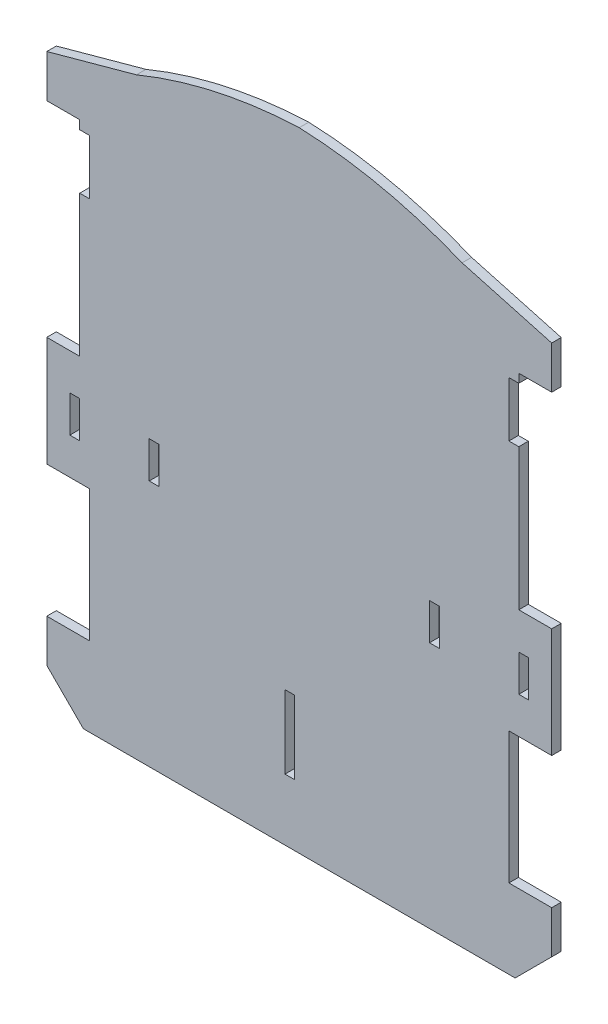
ISO-10303-21;
HEADER;
FILE_DESCRIPTION(('STEP AP214'),'2;1');
FILE_NAME('part.step','',(''),(''),'','','');
FILE_SCHEMA(('AUTOMOTIVE_DESIGN { 1 0 10303 214 1 1 1 1 }'));
ENDSEC;
DATA;
#1=APPLICATION_CONTEXT('core data for automotive mechanical design processes');
#2=APPLICATION_PROTOCOL_DEFINITION('international standard','automotive_design',2000,#1);
#3=PRODUCT_CONTEXT('',#1,'mechanical');
#4=PRODUCT('Part','Part','',(#3));
#5=PRODUCT_RELATED_PRODUCT_CATEGORY('part','',(#4));
#6=PRODUCT_DEFINITION_FORMATION('','',#4);
#7=PRODUCT_DEFINITION_CONTEXT('part definition',#1,'design');
#8=PRODUCT_DEFINITION('design','',#6,#7);
#9=PRODUCT_DEFINITION_SHAPE('','',#8);
#10=(LENGTH_UNIT() NAMED_UNIT(*) SI_UNIT(.MILLI.,.METRE.));
#11=(NAMED_UNIT(*) PLANE_ANGLE_UNIT() SI_UNIT($,.RADIAN.));
#12=(NAMED_UNIT(*) SI_UNIT($,.STERADIAN.) SOLID_ANGLE_UNIT());
#13=UNCERTAINTY_MEASURE_WITH_UNIT(LENGTH_MEASURE(1.E-05),#10,'distance_accuracy_value','');
#14=(GEOMETRIC_REPRESENTATION_CONTEXT(3) GLOBAL_UNCERTAINTY_ASSIGNED_CONTEXT((#13)) GLOBAL_UNIT_ASSIGNED_CONTEXT((#10,
#11,#12)) REPRESENTATION_CONTEXT('',''));
#15=CARTESIAN_POINT('',(0.,0.,0.));
#16=DIRECTION('',(0.,0.,1.));
#17=DIRECTION('',(1.,0.,0.));
#18=AXIS2_PLACEMENT_3D('',#15,#16,#17);
#19=CARTESIAN_POINT('',(3.88572449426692,-52.1850748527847,2.6));
#20=DIRECTION('',(0.,0.,1.));
#21=DIRECTION('',(1.,0.,0.));
#22=AXIS2_PLACEMENT_3D('',#19,#20,#21);
#23=PLANE('',#22);
#24=DIRECTION('',(1.,0.,0.));
#25=VECTOR('',#24,1.);
#26=CARTESIAN_POINT('',(-50.113710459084,-94.5270288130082,2.6));
#27=LINE('',#26,#25);
#28=CARTESIAN_POINT('',(-50.113710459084,-94.5270288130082,2.6));
#29=VERTEX_POINT('',#28);
#30=CARTESIAN_POINT('',(67.886289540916,-94.5270288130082,2.6));
#31=VERTEX_POINT('',#30);
#32=EDGE_CURVE('E531',#29,#31,#27,.T.);
#33=ORIENTED_EDGE('',*,*,#32,.T.);
#34=DIRECTION('',(0.707106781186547,0.707106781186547,0.));
#35=VECTOR('',#34,1.);
#36=CARTESIAN_POINT('',(67.886289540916,-94.5270288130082,2.6));
#37=LINE('',#36,#35);
#38=CARTESIAN_POINT('',(77.886289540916,-84.5270288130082,2.6));
#39=VERTEX_POINT('',#38);
#40=EDGE_CURVE('E534',#31,#39,#37,.T.);
#41=ORIENTED_EDGE('',*,*,#40,.T.);
#42=DIRECTION('',(0.,1.,0.));
#43=VECTOR('',#42,1.);
#44=CARTESIAN_POINT('',(77.886289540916,-84.5270288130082,2.6));
#45=LINE('',#44,#43);
#46=CARTESIAN_POINT('',(77.886289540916,-72.8820623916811,2.6));
#47=VERTEX_POINT('',#46);
#48=EDGE_CURVE('E537',#39,#47,#45,.T.);
#49=ORIENTED_EDGE('',*,*,#48,.T.);
#50=DIRECTION('',(-1.,0.,0.));
#51=VECTOR('',#50,1.);
#52=CARTESIAN_POINT('',(77.886289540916,-72.8820623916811,2.6));
#53=LINE('',#52,#51);
#54=CARTESIAN_POINT('',(66.1862895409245,-72.8820623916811,2.6));
#55=VERTEX_POINT('',#54);
#56=EDGE_CURVE('E539',#47,#55,#53,.T.);
#57=ORIENTED_EDGE('',*,*,#56,.T.);
#58=DIRECTION('',(0.,1.,0.));
#59=VECTOR('',#58,1.);
#60=CARTESIAN_POINT('',(66.1862895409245,-72.8820623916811,2.6));
#61=LINE('',#60,#59);
#62=CARTESIAN_POINT('',(66.1862895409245,-36.8820623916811,2.6));
#63=VERTEX_POINT('',#62);
#64=EDGE_CURVE('E541',#55,#63,#61,.T.);
#65=ORIENTED_EDGE('',*,*,#64,.T.);
#66=DIRECTION('',(1.,0.,0.));
#67=VECTOR('',#66,1.);
#68=CARTESIAN_POINT('',(66.1862895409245,-36.8820623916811,2.6));
#69=LINE('',#68,#67);
#70=CARTESIAN_POINT('',(77.8862895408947,-36.8820623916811,2.6));
#71=VERTEX_POINT('',#70);
#72=EDGE_CURVE('E543',#63,#71,#69,.T.);
#73=ORIENTED_EDGE('',*,*,#72,.T.);
#74=DIRECTION('',(0.,1.,0.));
#75=VECTOR('',#74,1.);
#76=CARTESIAN_POINT('',(77.8862895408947,-36.8820623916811,2.6));
#77=LINE('',#76,#75);
#78=CARTESIAN_POINT('',(77.8862895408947,-6.88206239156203,2.6));
#79=VERTEX_POINT('',#78);
#80=EDGE_CURVE('E545',#71,#79,#77,.T.);
#81=ORIENTED_EDGE('',*,*,#80,.T.);
#82=DIRECTION('',(-1.,0.,0.));
#83=VECTOR('',#82,1.);
#84=CARTESIAN_POINT('',(68.8862895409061,-6.88206239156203,2.6));
#85=LINE('',#84,#83);
#86=CARTESIAN_POINT('',(68.8862895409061,-6.88206239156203,2.6));
#87=VERTEX_POINT('',#86);
#88=EDGE_CURVE('E547',#79,#87,#85,.T.);
#89=ORIENTED_EDGE('',*,*,#88,.T.);
#90=DIRECTION('',(4.77689199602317E-13,1.,0.));
#91=VECTOR('',#90,1.);
#92=CARTESIAN_POINT('',(68.8862895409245,31.7279376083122,2.6));
#93=LINE('',#92,#91);
#94=CARTESIAN_POINT('',(68.8862895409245,31.7279376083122,2.6));
#95=VERTEX_POINT('',#94);
#96=EDGE_CURVE('E549',#87,#95,#93,.T.);
#97=ORIENTED_EDGE('',*,*,#96,.T.);
#98=DIRECTION('',(-1.,2.13820730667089E-12,0.));
#99=VECTOR('',#98,1.);
#100=CARTESIAN_POINT('',(66.1862895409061,31.727937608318,2.6));
#101=LINE('',#100,#99);
#102=CARTESIAN_POINT('',(66.1862895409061,31.727937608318,2.6));
#103=VERTEX_POINT('',#102);
#104=EDGE_CURVE('E551',#95,#103,#101,.T.);
#105=ORIENTED_EDGE('',*,*,#104,.T.);
#106=DIRECTION('',(0.,1.,0.));
#107=VECTOR('',#106,1.);
#108=CARTESIAN_POINT('',(66.1862895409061,46.7343894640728,2.6));
#109=LINE('',#108,#107);
#110=CARTESIAN_POINT('',(66.1862895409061,46.7343894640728,2.6));
#111=VERTEX_POINT('',#110);
#112=EDGE_CURVE('E553',#103,#111,#109,.T.);
#113=ORIENTED_EDGE('',*,*,#112,.T.);
#114=DIRECTION('',(1.,0.,0.));
#115=VECTOR('',#114,1.);
#116=CARTESIAN_POINT('',(68.8862895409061,46.7343894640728,2.6));
#117=LINE('',#116,#115);
#118=CARTESIAN_POINT('',(68.8862895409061,46.7343894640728,2.6));
#119=VERTEX_POINT('',#118);
#120=EDGE_CURVE('E555',#111,#119,#117,.T.);
#121=ORIENTED_EDGE('',*,*,#120,.T.);
#122=DIRECTION('',(0.,1.,0.));
#123=VECTOR('',#122,1.);
#124=CARTESIAN_POINT('',(68.8862895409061,49.117937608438,2.6));
#125=LINE('',#124,#123);
#126=CARTESIAN_POINT('',(68.8862895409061,49.117937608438,2.6));
#127=VERTEX_POINT('',#126);
#128=EDGE_CURVE('E557',#119,#127,#125,.T.);
#129=ORIENTED_EDGE('',*,*,#128,.T.);
#130=DIRECTION('',(1.,0.,0.));
#131=VECTOR('',#130,1.);
#132=CARTESIAN_POINT('',(68.8862895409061,49.117937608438,2.6));
#133=LINE('',#132,#131);
#134=CARTESIAN_POINT('',(77.886289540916,49.117937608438,2.6));
#135=VERTEX_POINT('',#134);
#136=EDGE_CURVE('E559',#127,#135,#133,.T.);
#137=ORIENTED_EDGE('',*,*,#136,.T.);
#138=DIRECTION('',(0.,1.,0.));
#139=VECTOR('',#138,1.);
#140=CARTESIAN_POINT('',(77.886289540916,60.762904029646,2.6));
#141=LINE('',#140,#139);
#142=CARTESIAN_POINT('',(77.886289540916,60.762904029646,2.6));
#143=VERTEX_POINT('',#142);
#144=EDGE_CURVE('E561',#135,#143,#141,.T.);
#145=ORIENTED_EDGE('',*,*,#144,.T.);
#146=DIRECTION('',(-0.964270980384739,0.264917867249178,0.));
#147=VECTOR('',#146,1.);
#148=CARTESIAN_POINT('',(77.886289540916,60.762904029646,2.6));
#149=LINE('',#148,#147);
#150=CARTESIAN_POINT('',(53.386289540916,67.4938830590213,2.6));
#151=VERTEX_POINT('',#150);
#152=EDGE_CURVE('E563',#143,#151,#149,.T.);
#153=ORIENTED_EDGE('',*,*,#152,.T.);
#154=CARTESIAN_POINT('',(3.88572449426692,-52.1850748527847,2.6));
#155=DIRECTION('',(0.,0.,1.));
#156=DIRECTION('',(1.,0.,0.));
#157=AXIS2_PLACEMENT_3D('',#154,#155,#156);
#158=CIRCLE('',#157,129.512002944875);
#159=CARTESIAN_POINT('',(8.88628954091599,77.2303541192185,2.6));
#160=VERTEX_POINT('',#159);
#161=EDGE_CURVE('E565',#151,#160,#158,.T.);
#162=ORIENTED_EDGE('',*,*,#161,.T.);
#163=CARTESIAN_POINT('',(13.8868545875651,-52.1850748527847,2.6));
#164=DIRECTION('',(0.,0.,1.));
#165=DIRECTION('',(-1.,0.,0.));
#166=AXIS2_PLACEMENT_3D('',#163,#164,#165);
#167=CIRCLE('',#166,129.512002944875);
#168=CARTESIAN_POINT('',(-35.613710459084,67.4938830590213,2.6));
#169=VERTEX_POINT('',#168);
#170=EDGE_CURVE('E567',#160,#169,#167,.T.);
#171=ORIENTED_EDGE('',*,*,#170,.T.);
#172=DIRECTION('',(-0.964270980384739,-0.264917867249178,0.));
#173=VECTOR('',#172,1.);
#174=CARTESIAN_POINT('',(-60.113710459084,60.762904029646,2.6));
#175=LINE('',#174,#173);
#176=CARTESIAN_POINT('',(-60.113710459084,60.762904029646,2.6));
#177=VERTEX_POINT('',#176);
#178=EDGE_CURVE('E569',#169,#177,#175,.T.);
#179=ORIENTED_EDGE('',*,*,#178,.T.);
#180=DIRECTION('',(0.,-1.,0.));
#181=VECTOR('',#180,1.);
#182=CARTESIAN_POINT('',(-60.113710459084,60.762904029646,2.6));
#183=LINE('',#182,#181);
#184=CARTESIAN_POINT('',(-60.113710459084,49.1179376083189,2.6));
#185=VERTEX_POINT('',#184);
#186=EDGE_CURVE('E571',#177,#185,#183,.T.);
#187=ORIENTED_EDGE('',*,*,#186,.T.);
#188=DIRECTION('',(1.,0.,0.));
#189=VECTOR('',#188,1.);
#190=CARTESIAN_POINT('',(-51.113710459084,49.1179376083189,2.6));
#191=LINE('',#190,#189);
#192=CARTESIAN_POINT('',(-51.113710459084,49.1179376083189,2.6));
#193=VERTEX_POINT('',#192);
#194=EDGE_CURVE('E573',#185,#193,#191,.T.);
#195=ORIENTED_EDGE('',*,*,#194,.T.);
#196=DIRECTION('',(0.,-1.,0.));
#197=VECTOR('',#196,1.);
#198=CARTESIAN_POINT('',(-51.113710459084,49.1179376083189,2.6));
#199=LINE('',#198,#197);
#200=CARTESIAN_POINT('',(-51.113710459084,46.7343894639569,2.6));
#201=VERTEX_POINT('',#200);
#202=EDGE_CURVE('E575',#193,#201,#199,.T.);
#203=ORIENTED_EDGE('',*,*,#202,.T.);
#204=DIRECTION('',(1.,0.,0.));
#205=VECTOR('',#204,1.);
#206=CARTESIAN_POINT('',(-51.113710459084,46.7343894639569,2.6));
#207=LINE('',#206,#205);
#208=CARTESIAN_POINT('',(-48.413710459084,46.7343894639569,2.6));
#209=VERTEX_POINT('',#208);
#210=EDGE_CURVE('E577',#201,#209,#207,.T.);
#211=ORIENTED_EDGE('',*,*,#210,.T.);
#212=DIRECTION('',(0.,-1.,0.));
#213=VECTOR('',#212,1.);
#214=CARTESIAN_POINT('',(-48.413710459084,46.7343894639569,2.6));
#215=LINE('',#214,#213);
#216=CARTESIAN_POINT('',(-48.413710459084,31.7279376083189,2.6));
#217=VERTEX_POINT('',#216);
#218=EDGE_CURVE('E579',#209,#217,#215,.T.);
#219=ORIENTED_EDGE('',*,*,#218,.T.);
#220=DIRECTION('',(-1.,0.,0.));
#221=VECTOR('',#220,1.);
#222=CARTESIAN_POINT('',(-48.413710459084,31.7279376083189,2.6));
#223=LINE('',#222,#221);
#224=CARTESIAN_POINT('',(-51.113710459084,31.7279376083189,2.6));
#225=VERTEX_POINT('',#224);
#226=EDGE_CURVE('E581',#217,#225,#223,.T.);
#227=ORIENTED_EDGE('',*,*,#226,.T.);
#228=DIRECTION('',(0.,-1.,0.));
#229=VECTOR('',#228,1.);
#230=CARTESIAN_POINT('',(-51.113710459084,31.7279376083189,2.6));
#231=LINE('',#230,#229);
#232=CARTESIAN_POINT('',(-51.113710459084,-6.8820623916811,2.6));
#233=VERTEX_POINT('',#232);
#234=EDGE_CURVE('E583',#225,#233,#231,.T.);
#235=ORIENTED_EDGE('',*,*,#234,.T.);
#236=DIRECTION('',(-1.,0.,0.));
#237=VECTOR('',#236,1.);
#238=CARTESIAN_POINT('',(-51.113710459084,-6.8820623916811,2.6));
#239=LINE('',#238,#237);
#240=CARTESIAN_POINT('',(-60.113710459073,-6.8820623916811,2.6));
#241=VERTEX_POINT('',#240);
#242=EDGE_CURVE('E585',#233,#241,#239,.T.);
#243=ORIENTED_EDGE('',*,*,#242,.T.);
#244=DIRECTION('',(0.,-1.,0.));
#245=VECTOR('',#244,1.);
#246=CARTESIAN_POINT('',(-60.113710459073,-36.8820623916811,2.6));
#247=LINE('',#246,#245);
#248=CARTESIAN_POINT('',(-60.113710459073,-36.8820623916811,2.6));
#249=VERTEX_POINT('',#248);
#250=EDGE_CURVE('E587',#241,#249,#247,.T.);
#251=ORIENTED_EDGE('',*,*,#250,.T.);
#252=DIRECTION('',(1.,0.,0.));
#253=VECTOR('',#252,1.);
#254=CARTESIAN_POINT('',(-48.4137104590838,-36.8820623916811,2.6));
#255=LINE('',#254,#253);
#256=CARTESIAN_POINT('',(-48.4137104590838,-36.8820623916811,2.6));
#257=VERTEX_POINT('',#256);
#258=EDGE_CURVE('E589',#249,#257,#255,.T.);
#259=ORIENTED_EDGE('',*,*,#258,.T.);
#260=DIRECTION('',(0.,-1.,0.));
#261=VECTOR('',#260,1.);
#262=CARTESIAN_POINT('',(-48.4137104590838,-72.8820623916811,2.6));
#263=LINE('',#262,#261);
#264=CARTESIAN_POINT('',(-48.4137104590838,-72.8820623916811,2.6));
#265=VERTEX_POINT('',#264);
#266=EDGE_CURVE('E591',#257,#265,#263,.T.);
#267=ORIENTED_EDGE('',*,*,#266,.T.);
#268=DIRECTION('',(-1.,0.,0.));
#269=VECTOR('',#268,1.);
#270=CARTESIAN_POINT('',(-60.113710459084,-72.8820623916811,2.6));
#271=LINE('',#270,#269);
#272=CARTESIAN_POINT('',(-60.113710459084,-72.8820623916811,2.6));
#273=VERTEX_POINT('',#272);
#274=EDGE_CURVE('E593',#265,#273,#271,.T.);
#275=ORIENTED_EDGE('',*,*,#274,.T.);
#276=DIRECTION('',(0.,-1.,0.));
#277=VECTOR('',#276,1.);
#278=CARTESIAN_POINT('',(-60.113710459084,-84.5270288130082,2.6));
#279=LINE('',#278,#277);
#280=CARTESIAN_POINT('',(-60.113710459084,-84.5270288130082,2.6));
#281=VERTEX_POINT('',#280);
#282=EDGE_CURVE('E595',#273,#281,#279,.T.);
#283=ORIENTED_EDGE('',*,*,#282,.T.);
#284=DIRECTION('',(0.707106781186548,-0.707106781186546,0.));
#285=VECTOR('',#284,1.);
#286=CARTESIAN_POINT('',(-50.113710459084,-94.5270288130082,2.6));
#287=LINE('',#286,#285);
#288=EDGE_CURVE('E597',#281,#29,#287,.T.);
#289=ORIENTED_EDGE('',*,*,#288,.T.);
#290=EDGE_LOOP('',(#33,#41,#49,#57,#65,#73,#81,#89,#97,#105,#113,#121,#129,#137,#145,#153,#162,
#171,#179,#187,#195,#203,#211,#219,#227,#235,#243,#251,#259,#267,#275,#283,#289));
#291=FACE_BOUND('',#290,.T.);
#292=DIRECTION('',(0.,1.,0.));
#293=VECTOR('',#292,1.);
#294=CARTESIAN_POINT('',(-51.113710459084,-26.8820623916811,2.6));
#295=LINE('',#294,#293);
#296=CARTESIAN_POINT('',(-51.113710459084,-26.8820623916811,2.6));
#297=VERTEX_POINT('',#296);
#298=CARTESIAN_POINT('',(-51.113710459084,-16.8820623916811,2.6));
#299=VERTEX_POINT('',#298);
#300=EDGE_CURVE('E502',#297,#299,#295,.T.);
#301=ORIENTED_EDGE('',*,*,#300,.F.);
#302=DIRECTION('',(1.,0.,0.));
#303=VECTOR('',#302,1.);
#304=CARTESIAN_POINT('',(-53.813710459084,-26.8820623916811,2.6));
#305=LINE('',#304,#303);
#306=CARTESIAN_POINT('',(-53.813710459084,-26.8820623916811,2.6));
#307=VERTEX_POINT('',#306);
#308=EDGE_CURVE('E500',#307,#297,#305,.T.);
#309=ORIENTED_EDGE('',*,*,#308,.F.);
#310=DIRECTION('',(0.,-1.,0.));
#311=VECTOR('',#310,1.);
#312=CARTESIAN_POINT('',(-53.813710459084,-26.8820623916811,2.6));
#313=LINE('',#312,#311);
#314=CARTESIAN_POINT('',(-53.813710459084,-16.8820623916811,2.6));
#315=VERTEX_POINT('',#314);
#316=EDGE_CURVE('E508',#315,#307,#313,.T.);
#317=ORIENTED_EDGE('',*,*,#316,.F.);
#318=DIRECTION('',(-1.,0.,0.));
#319=VECTOR('',#318,1.);
#320=CARTESIAN_POINT('',(-53.813710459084,-16.8820623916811,2.6));
#321=LINE('',#320,#319);
#322=EDGE_CURVE('E505',#299,#315,#321,.T.);
#323=ORIENTED_EDGE('',*,*,#322,.F.);
#324=EDGE_LOOP('',(#301,#309,#317,#323));
#325=FACE_BOUND('',#324,.T.);
#326=DIRECTION('',(-1.,0.,0.));
#327=VECTOR('',#326,1.);
#328=CARTESIAN_POINT('',(47.1862895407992,-16.8820623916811,2.6));
#329=LINE('',#328,#327);
#330=CARTESIAN_POINT('',(47.1862895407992,-16.8820623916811,2.6));
#331=VERTEX_POINT('',#330);
#332=CARTESIAN_POINT('',(44.4862895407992,-16.8820623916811,2.6));
#333=VERTEX_POINT('',#332);
#334=EDGE_CURVE('E471',#331,#333,#329,.T.);
#335=ORIENTED_EDGE('',*,*,#334,.F.);
#336=DIRECTION('',(0.,1.,0.));
#337=VECTOR('',#336,1.);
#338=CARTESIAN_POINT('',(47.1862895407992,-26.8820623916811,2.6));
#339=LINE('',#338,#337);
#340=CARTESIAN_POINT('',(47.1862895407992,-26.8820623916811,2.6));
#341=VERTEX_POINT('',#340);
#342=EDGE_CURVE('E469',#341,#331,#339,.T.);
#343=ORIENTED_EDGE('',*,*,#342,.F.);
#344=DIRECTION('',(1.,0.,0.));
#345=VECTOR('',#344,1.);
#346=CARTESIAN_POINT('',(47.1862895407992,-26.8820623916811,2.6));
#347=LINE('',#346,#345);
#348=CARTESIAN_POINT('',(44.4862895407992,-26.8820623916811,2.6));
#349=VERTEX_POINT('',#348);
#350=EDGE_CURVE('E477',#349,#341,#347,.T.);
#351=ORIENTED_EDGE('',*,*,#350,.F.);
#352=DIRECTION('',(0.,-1.,0.));
#353=VECTOR('',#352,1.);
#354=CARTESIAN_POINT('',(44.4862895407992,-26.8820623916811,2.6));
#355=LINE('',#354,#353);
#356=EDGE_CURVE('E474',#333,#349,#355,.T.);
#357=ORIENTED_EDGE('',*,*,#356,.F.);
#358=EDGE_LOOP('',(#335,#343,#351,#357));
#359=FACE_BOUND('',#358,.T.);
#360=DIRECTION('',(-1.,0.,0.));
#361=VECTOR('',#360,1.);
#362=CARTESIAN_POINT('',(71.586289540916,-16.8820623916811,2.6));
#363=LINE('',#362,#361);
#364=CARTESIAN_POINT('',(71.586289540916,-16.8820623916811,2.6));
#365=VERTEX_POINT('',#364);
#366=CARTESIAN_POINT('',(68.886289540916,-16.8820623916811,2.6));
#367=VERTEX_POINT('',#366);
#368=EDGE_CURVE('E440',#365,#367,#363,.T.);
#369=ORIENTED_EDGE('',*,*,#368,.F.);
#370=DIRECTION('',(0.,1.,0.));
#371=VECTOR('',#370,1.);
#372=CARTESIAN_POINT('',(71.586289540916,-26.8820623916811,2.6));
#373=LINE('',#372,#371);
#374=CARTESIAN_POINT('',(71.586289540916,-26.8820623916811,2.6));
#375=VERTEX_POINT('',#374);
#376=EDGE_CURVE('E438',#375,#365,#373,.T.);
#377=ORIENTED_EDGE('',*,*,#376,.F.);
#378=DIRECTION('',(1.,0.,0.));
#379=VECTOR('',#378,1.);
#380=CARTESIAN_POINT('',(71.586289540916,-26.8820623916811,2.6));
#381=LINE('',#380,#379);
#382=CARTESIAN_POINT('',(68.886289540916,-26.8820623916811,2.6));
#383=VERTEX_POINT('',#382);
#384=EDGE_CURVE('E446',#383,#375,#381,.T.);
#385=ORIENTED_EDGE('',*,*,#384,.F.);
#386=DIRECTION('',(0.,-1.,0.));
#387=VECTOR('',#386,1.);
#388=CARTESIAN_POINT('',(68.886289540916,-26.8820623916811,2.6));
#389=LINE('',#388,#387);
#390=EDGE_CURVE('E443',#367,#383,#389,.T.);
#391=ORIENTED_EDGE('',*,*,#390,.F.);
#392=EDGE_LOOP('',(#369,#377,#385,#391));
#393=FACE_BOUND('',#392,.T.);
#394=DIRECTION('',(0.,1.,0.));
#395=VECTOR('',#394,1.);
#396=CARTESIAN_POINT('',(-29.413710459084,-26.8820623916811,2.6));
#397=LINE('',#396,#395);
#398=CARTESIAN_POINT('',(-29.413710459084,-26.8820623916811,2.6));
#399=VERTEX_POINT('',#398);
#400=CARTESIAN_POINT('',(-29.413710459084,-16.8820623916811,2.6));
#401=VERTEX_POINT('',#400);
#402=EDGE_CURVE('E409',#399,#401,#397,.T.);
#403=ORIENTED_EDGE('',*,*,#402,.F.);
#404=DIRECTION('',(1.,0.,0.));
#405=VECTOR('',#404,1.);
#406=CARTESIAN_POINT('',(-32.113710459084,-26.8820623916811,2.6));
#407=LINE('',#406,#405);
#408=CARTESIAN_POINT('',(-32.113710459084,-26.8820623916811,2.6));
#409=VERTEX_POINT('',#408);
#410=EDGE_CURVE('E407',#409,#399,#407,.T.);
#411=ORIENTED_EDGE('',*,*,#410,.F.);
#412=DIRECTION('',(0.,-1.,0.));
#413=VECTOR('',#412,1.);
#414=CARTESIAN_POINT('',(-32.113710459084,-26.8820623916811,2.6));
#415=LINE('',#414,#413);
#416=CARTESIAN_POINT('',(-32.113710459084,-16.8820623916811,2.6));
#417=VERTEX_POINT('',#416);
#418=EDGE_CURVE('E415',#417,#409,#415,.T.);
#419=ORIENTED_EDGE('',*,*,#418,.F.);
#420=DIRECTION('',(-1.,0.,0.));
#421=VECTOR('',#420,1.);
#422=CARTESIAN_POINT('',(-32.113710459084,-16.8820623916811,2.6));
#423=LINE('',#422,#421);
#424=EDGE_CURVE('E412',#401,#417,#423,.T.);
#425=ORIENTED_EDGE('',*,*,#424,.F.);
#426=EDGE_LOOP('',(#403,#411,#419,#425));
#427=FACE_BOUND('',#426,.T.);
#428=DIRECTION('',(-1.,0.,0.));
#429=VECTOR('',#428,1.);
#430=CARTESIAN_POINT('',(7.586289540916,-57.7153678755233,2.6));
#431=LINE('',#430,#429);
#432=CARTESIAN_POINT('',(7.586289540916,-57.7153678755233,2.6));
#433=VERTEX_POINT('',#432);
#434=CARTESIAN_POINT('',(4.986289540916,-57.7153678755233,2.6));
#435=VERTEX_POINT('',#434);
#436=EDGE_CURVE('E379',#433,#435,#431,.T.);
#437=ORIENTED_EDGE('',*,*,#436,.F.);
#438=DIRECTION('',(0.,1.,0.));
#439=VECTOR('',#438,1.);
#440=CARTESIAN_POINT('',(7.586289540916,-77.7153678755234,2.6));
#441=LINE('',#440,#439);
#442=CARTESIAN_POINT('',(7.586289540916,-77.7153678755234,2.6));
#443=VERTEX_POINT('',#442);
#444=EDGE_CURVE('E371',#443,#433,#441,.T.);
#445=ORIENTED_EDGE('',*,*,#444,.F.);
#446=DIRECTION('',(1.,0.,0.));
#447=VECTOR('',#446,1.);
#448=CARTESIAN_POINT('',(7.586289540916,-77.7153678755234,2.6));
#449=LINE('',#448,#447);
#450=CARTESIAN_POINT('',(4.986289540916,-77.7153678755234,2.6));
#451=VERTEX_POINT('',#450);
#452=EDGE_CURVE('E393',#451,#443,#449,.T.);
#453=ORIENTED_EDGE('',*,*,#452,.F.);
#454=DIRECTION('',(0.,-1.,0.));
#455=VECTOR('',#454,1.);
#456=CARTESIAN_POINT('',(4.986289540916,-77.7153678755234,2.6));
#457=LINE('',#456,#455);
#458=EDGE_CURVE('E391',#435,#451,#457,.T.);
#459=ORIENTED_EDGE('',*,*,#458,.F.);
#460=EDGE_LOOP('',(#437,#445,#453,#459));
#461=FACE_BOUND('',#460,.T.);
#462=ADVANCED_FACE('F36',(#291,#325,#359,#393,#427,#461),#23,.T.);
#463=CARTESIAN_POINT('',(3.88572449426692,-52.1850748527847,0.));
#464=DIRECTION('',(0.,0.,1.));
#465=DIRECTION('',(1.,0.,0.));
#466=AXIS2_PLACEMENT_3D('',#463,#464,#465);
#467=PLANE('',#466);
#468=DIRECTION('',(1.,0.,0.));
#469=VECTOR('',#468,1.);
#470=CARTESIAN_POINT('',(-32.113710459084,-26.8820623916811,0.));
#471=LINE('',#470,#469);
#472=CARTESIAN_POINT('',(-32.113710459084,-26.8820623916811,0.));
#473=VERTEX_POINT('',#472);
#474=CARTESIAN_POINT('',(-29.413710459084,-26.8820623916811,0.));
#475=VERTEX_POINT('',#474);
#476=EDGE_CURVE('E387',#473,#475,#471,.T.);
#477=ORIENTED_EDGE('',*,*,#476,.T.);
#478=DIRECTION('',(0.,1.,0.));
#479=VECTOR('',#478,1.);
#480=CARTESIAN_POINT('',(-29.413710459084,-26.8820623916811,0.));
#481=LINE('',#480,#479);
#482=CARTESIAN_POINT('',(-29.413710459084,-16.8820623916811,0.));
#483=VERTEX_POINT('',#482);
#484=EDGE_CURVE('E420',#475,#483,#481,.T.);
#485=ORIENTED_EDGE('',*,*,#484,.T.);
#486=DIRECTION('',(-1.,0.,0.));
#487=VECTOR('',#486,1.);
#488=CARTESIAN_POINT('',(-32.113710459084,-16.8820623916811,0.));
#489=LINE('',#488,#487);
#490=CARTESIAN_POINT('',(-32.113710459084,-16.8820623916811,0.));
#491=VERTEX_POINT('',#490);
#492=EDGE_CURVE('E423',#483,#491,#489,.T.);
#493=ORIENTED_EDGE('',*,*,#492,.T.);
#494=DIRECTION('',(0.,-1.,0.));
#495=VECTOR('',#494,1.);
#496=CARTESIAN_POINT('',(-32.113710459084,-26.8820623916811,0.));
#497=LINE('',#496,#495);
#498=EDGE_CURVE('E410',#491,#473,#497,.T.);
#499=ORIENTED_EDGE('',*,*,#498,.T.);
#500=EDGE_LOOP('',(#477,#485,#493,#499));
#501=FACE_BOUND('',#500,.T.);
#502=DIRECTION('',(0.,1.,0.));
#503=VECTOR('',#502,1.);
#504=CARTESIAN_POINT('',(47.1862895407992,-26.8820623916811,0.));
#505=LINE('',#504,#503);
#506=CARTESIAN_POINT('',(47.1862895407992,-26.8820623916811,0.));
#507=VERTEX_POINT('',#506);
#508=CARTESIAN_POINT('',(47.1862895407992,-16.8820623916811,0.));
#509=VERTEX_POINT('',#508);
#510=EDGE_CURVE('E468',#507,#509,#505,.T.);
#511=ORIENTED_EDGE('',*,*,#510,.T.);
#512=DIRECTION('',(-1.,0.,0.));
#513=VECTOR('',#512,1.);
#514=CARTESIAN_POINT('',(47.1862895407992,-16.8820623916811,0.));
#515=LINE('',#514,#513);
#516=CARTESIAN_POINT('',(44.4862895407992,-16.8820623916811,0.));
#517=VERTEX_POINT('',#516);
#518=EDGE_CURVE('E482',#509,#517,#515,.T.);
#519=ORIENTED_EDGE('',*,*,#518,.T.);
#520=DIRECTION('',(0.,-1.,0.));
#521=VECTOR('',#520,1.);
#522=CARTESIAN_POINT('',(44.4862895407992,-26.8820623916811,0.));
#523=LINE('',#522,#521);
#524=CARTESIAN_POINT('',(44.4862895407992,-26.8820623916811,0.));
#525=VERTEX_POINT('',#524);
#526=EDGE_CURVE('E485',#517,#525,#523,.T.);
#527=ORIENTED_EDGE('',*,*,#526,.T.);
#528=DIRECTION('',(1.,0.,0.));
#529=VECTOR('',#528,1.);
#530=CARTESIAN_POINT('',(47.1862895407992,-26.8820623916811,0.));
#531=LINE('',#530,#529);
#532=EDGE_CURVE('E472',#525,#507,#531,.T.);
#533=ORIENTED_EDGE('',*,*,#532,.T.);
#534=EDGE_LOOP('',(#511,#519,#527,#533));
#535=FACE_BOUND('',#534,.T.);
#536=DIRECTION('',(1.,0.,0.));
#537=VECTOR('',#536,1.);
#538=CARTESIAN_POINT('',(-50.113710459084,-94.5270288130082,0.));
#539=LINE('',#538,#537);
#540=CARTESIAN_POINT('',(-50.113710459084,-94.5270288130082,0.));
#541=VERTEX_POINT('',#540);
#542=CARTESIAN_POINT('',(67.886289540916,-94.5270288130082,0.));
#543=VERTEX_POINT('',#542);
#544=EDGE_CURVE('E530',#541,#543,#539,.T.);
#545=ORIENTED_EDGE('',*,*,#544,.F.);
#546=DIRECTION('',(0.707106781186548,-0.707106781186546,0.));
#547=VECTOR('',#546,1.);
#548=CARTESIAN_POINT('',(-50.113710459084,-94.5270288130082,0.));
#549=LINE('',#548,#547);
#550=CARTESIAN_POINT('',(-60.113710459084,-84.5270288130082,0.));
#551=VERTEX_POINT('',#550);
#552=EDGE_CURVE('E535',#551,#541,#549,.T.);
#553=ORIENTED_EDGE('',*,*,#552,.F.);
#554=DIRECTION('',(0.,-1.,0.));
#555=VECTOR('',#554,1.);
#556=CARTESIAN_POINT('',(-60.113710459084,-84.5270288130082,0.));
#557=LINE('',#556,#555);
#558=CARTESIAN_POINT('',(-60.113710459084,-72.8820623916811,0.));
#559=VERTEX_POINT('',#558);
#560=EDGE_CURVE('E662',#559,#551,#557,.T.);
#561=ORIENTED_EDGE('',*,*,#560,.F.);
#562=DIRECTION('',(-1.,0.,0.));
#563=VECTOR('',#562,1.);
#564=CARTESIAN_POINT('',(-60.113710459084,-72.8820623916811,0.));
#565=LINE('',#564,#563);
#566=CARTESIAN_POINT('',(-48.4137104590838,-72.8820623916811,0.));
#567=VERTEX_POINT('',#566);
#568=EDGE_CURVE('E660',#567,#559,#565,.T.);
#569=ORIENTED_EDGE('',*,*,#568,.F.);
#570=DIRECTION('',(0.,-1.,0.));
#571=VECTOR('',#570,1.);
#572=CARTESIAN_POINT('',(-48.4137104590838,-72.8820623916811,0.));
#573=LINE('',#572,#571);
#574=CARTESIAN_POINT('',(-48.4137104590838,-36.8820623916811,0.));
#575=VERTEX_POINT('',#574);
#576=EDGE_CURVE('E658',#575,#567,#573,.T.);
#577=ORIENTED_EDGE('',*,*,#576,.F.);
#578=DIRECTION('',(1.,0.,0.));
#579=VECTOR('',#578,1.);
#580=CARTESIAN_POINT('',(-48.4137104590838,-36.8820623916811,0.));
#581=LINE('',#580,#579);
#582=CARTESIAN_POINT('',(-60.113710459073,-36.8820623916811,0.));
#583=VERTEX_POINT('',#582);
#584=EDGE_CURVE('E656',#583,#575,#581,.T.);
#585=ORIENTED_EDGE('',*,*,#584,.F.);
#586=DIRECTION('',(0.,-1.,0.));
#587=VECTOR('',#586,1.);
#588=CARTESIAN_POINT('',(-60.113710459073,-36.8820623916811,0.));
#589=LINE('',#588,#587);
#590=CARTESIAN_POINT('',(-60.113710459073,-6.8820623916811,0.));
#591=VERTEX_POINT('',#590);
#592=EDGE_CURVE('E654',#591,#583,#589,.T.);
#593=ORIENTED_EDGE('',*,*,#592,.F.);
#594=DIRECTION('',(-1.,0.,0.));
#595=VECTOR('',#594,1.);
#596=CARTESIAN_POINT('',(-51.113710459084,-6.8820623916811,0.));
#597=LINE('',#596,#595);
#598=CARTESIAN_POINT('',(-51.113710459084,-6.8820623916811,0.));
#599=VERTEX_POINT('',#598);
#600=EDGE_CURVE('E652',#599,#591,#597,.T.);
#601=ORIENTED_EDGE('',*,*,#600,.F.);
#602=DIRECTION('',(0.,-1.,0.));
#603=VECTOR('',#602,1.);
#604=CARTESIAN_POINT('',(-51.113710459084,31.7279376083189,0.));
#605=LINE('',#604,#603);
#606=CARTESIAN_POINT('',(-51.113710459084,31.7279376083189,0.));
#607=VERTEX_POINT('',#606);
#608=EDGE_CURVE('E650',#607,#599,#605,.T.);
#609=ORIENTED_EDGE('',*,*,#608,.F.);
#610=DIRECTION('',(-1.,0.,0.));
#611=VECTOR('',#610,1.);
#612=CARTESIAN_POINT('',(-48.413710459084,31.7279376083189,0.));
#613=LINE('',#612,#611);
#614=CARTESIAN_POINT('',(-48.413710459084,31.7279376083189,0.));
#615=VERTEX_POINT('',#614);
#616=EDGE_CURVE('E648',#615,#607,#613,.T.);
#617=ORIENTED_EDGE('',*,*,#616,.F.);
#618=DIRECTION('',(0.,-1.,0.));
#619=VECTOR('',#618,1.);
#620=CARTESIAN_POINT('',(-48.413710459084,46.7343894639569,0.));
#621=LINE('',#620,#619);
#622=CARTESIAN_POINT('',(-48.413710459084,46.7343894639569,0.));
#623=VERTEX_POINT('',#622);
#624=EDGE_CURVE('E646',#623,#615,#621,.T.);
#625=ORIENTED_EDGE('',*,*,#624,.F.);
#626=DIRECTION('',(1.,0.,0.));
#627=VECTOR('',#626,1.);
#628=CARTESIAN_POINT('',(-51.113710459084,46.7343894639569,0.));
#629=LINE('',#628,#627);
#630=CARTESIAN_POINT('',(-51.113710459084,46.7343894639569,0.));
#631=VERTEX_POINT('',#630);
#632=EDGE_CURVE('E644',#631,#623,#629,.T.);
#633=ORIENTED_EDGE('',*,*,#632,.F.);
#634=DIRECTION('',(0.,-1.,0.));
#635=VECTOR('',#634,1.);
#636=CARTESIAN_POINT('',(-51.113710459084,49.1179376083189,0.));
#637=LINE('',#636,#635);
#638=CARTESIAN_POINT('',(-51.113710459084,49.1179376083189,0.));
#639=VERTEX_POINT('',#638);
#640=EDGE_CURVE('E642',#639,#631,#637,.T.);
#641=ORIENTED_EDGE('',*,*,#640,.F.);
#642=DIRECTION('',(1.,0.,0.));
#643=VECTOR('',#642,1.);
#644=CARTESIAN_POINT('',(-51.113710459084,49.1179376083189,0.));
#645=LINE('',#644,#643);
#646=CARTESIAN_POINT('',(-60.113710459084,49.1179376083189,0.));
#647=VERTEX_POINT('',#646);
#648=EDGE_CURVE('E640',#647,#639,#645,.T.);
#649=ORIENTED_EDGE('',*,*,#648,.F.);
#650=DIRECTION('',(0.,-1.,0.));
#651=VECTOR('',#650,1.);
#652=CARTESIAN_POINT('',(-60.113710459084,60.762904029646,0.));
#653=LINE('',#652,#651);
#654=CARTESIAN_POINT('',(-60.113710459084,60.762904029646,0.));
#655=VERTEX_POINT('',#654);
#656=EDGE_CURVE('E638',#655,#647,#653,.T.);
#657=ORIENTED_EDGE('',*,*,#656,.F.);
#658=DIRECTION('',(-0.964270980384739,-0.264917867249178,0.));
#659=VECTOR('',#658,1.);
#660=CARTESIAN_POINT('',(-60.113710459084,60.762904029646,0.));
#661=LINE('',#660,#659);
#662=CARTESIAN_POINT('',(-35.613710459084,67.4938830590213,0.));
#663=VERTEX_POINT('',#662);
#664=EDGE_CURVE('E636',#663,#655,#661,.T.);
#665=ORIENTED_EDGE('',*,*,#664,.F.);
#666=CARTESIAN_POINT('',(13.8868545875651,-52.1850748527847,0.));
#667=DIRECTION('',(0.,0.,1.));
#668=DIRECTION('',(-1.,0.,0.));
#669=AXIS2_PLACEMENT_3D('',#666,#667,#668);
#670=CIRCLE('',#669,129.512002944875);
#671=CARTESIAN_POINT('',(8.88628954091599,77.2303541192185,0.));
#672=VERTEX_POINT('',#671);
#673=EDGE_CURVE('E634',#672,#663,#670,.T.);
#674=ORIENTED_EDGE('',*,*,#673,.F.);
#675=CARTESIAN_POINT('',(3.88572449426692,-52.1850748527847,0.));
#676=DIRECTION('',(0.,0.,1.));
#677=DIRECTION('',(1.,0.,0.));
#678=AXIS2_PLACEMENT_3D('',#675,#676,#677);
#679=CIRCLE('',#678,129.512002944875);
#680=CARTESIAN_POINT('',(53.386289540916,67.4938830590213,0.));
#681=VERTEX_POINT('',#680);
#682=EDGE_CURVE('E632',#681,#672,#679,.T.);
#683=ORIENTED_EDGE('',*,*,#682,.F.);
#684=DIRECTION('',(-0.964270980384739,0.264917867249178,0.));
#685=VECTOR('',#684,1.);
#686=CARTESIAN_POINT('',(77.886289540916,60.762904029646,0.));
#687=LINE('',#686,#685);
#688=CARTESIAN_POINT('',(77.886289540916,60.762904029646,0.));
#689=VERTEX_POINT('',#688);
#690=EDGE_CURVE('E630',#689,#681,#687,.T.);
#691=ORIENTED_EDGE('',*,*,#690,.F.);
#692=DIRECTION('',(0.,1.,0.));
#693=VECTOR('',#692,1.);
#694=CARTESIAN_POINT('',(77.886289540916,60.762904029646,0.));
#695=LINE('',#694,#693);
#696=CARTESIAN_POINT('',(77.886289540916,49.117937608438,0.));
#697=VERTEX_POINT('',#696);
#698=EDGE_CURVE('E628',#697,#689,#695,.T.);
#699=ORIENTED_EDGE('',*,*,#698,.F.);
#700=DIRECTION('',(1.,0.,0.));
#701=VECTOR('',#700,1.);
#702=CARTESIAN_POINT('',(68.8862895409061,49.117937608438,0.));
#703=LINE('',#702,#701);
#704=CARTESIAN_POINT('',(68.8862895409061,49.117937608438,0.));
#705=VERTEX_POINT('',#704);
#706=EDGE_CURVE('E626',#705,#697,#703,.T.);
#707=ORIENTED_EDGE('',*,*,#706,.F.);
#708=DIRECTION('',(0.,1.,0.));
#709=VECTOR('',#708,1.);
#710=CARTESIAN_POINT('',(68.8862895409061,49.117937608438,0.));
#711=LINE('',#710,#709);
#712=CARTESIAN_POINT('',(68.8862895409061,46.7343894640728,0.));
#713=VERTEX_POINT('',#712);
#714=EDGE_CURVE('E624',#713,#705,#711,.T.);
#715=ORIENTED_EDGE('',*,*,#714,.F.);
#716=DIRECTION('',(1.,0.,0.));
#717=VECTOR('',#716,1.);
#718=CARTESIAN_POINT('',(68.8862895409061,46.7343894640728,0.));
#719=LINE('',#718,#717);
#720=CARTESIAN_POINT('',(66.1862895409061,46.7343894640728,0.));
#721=VERTEX_POINT('',#720);
#722=EDGE_CURVE('E622',#721,#713,#719,.T.);
#723=ORIENTED_EDGE('',*,*,#722,.F.);
#724=DIRECTION('',(0.,1.,0.));
#725=VECTOR('',#724,1.);
#726=CARTESIAN_POINT('',(66.1862895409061,46.7343894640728,0.));
#727=LINE('',#726,#725);
#728=CARTESIAN_POINT('',(66.1862895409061,31.727937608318,0.));
#729=VERTEX_POINT('',#728);
#730=EDGE_CURVE('E620',#729,#721,#727,.T.);
#731=ORIENTED_EDGE('',*,*,#730,.F.);
#732=DIRECTION('',(-1.,2.13820730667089E-12,0.));
#733=VECTOR('',#732,1.);
#734=CARTESIAN_POINT('',(66.1862895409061,31.727937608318,0.));
#735=LINE('',#734,#733);
#736=CARTESIAN_POINT('',(68.8862895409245,31.7279376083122,0.));
#737=VERTEX_POINT('',#736);
#738=EDGE_CURVE('E618',#737,#729,#735,.T.);
#739=ORIENTED_EDGE('',*,*,#738,.F.);
#740=DIRECTION('',(4.77689199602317E-13,1.,0.));
#741=VECTOR('',#740,1.);
#742=CARTESIAN_POINT('',(68.8862895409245,31.7279376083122,0.));
#743=LINE('',#742,#741);
#744=CARTESIAN_POINT('',(68.8862895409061,-6.88206239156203,0.));
#745=VERTEX_POINT('',#744);
#746=EDGE_CURVE('E616',#745,#737,#743,.T.);
#747=ORIENTED_EDGE('',*,*,#746,.F.);
#748=DIRECTION('',(-1.,0.,0.));
#749=VECTOR('',#748,1.);
#750=CARTESIAN_POINT('',(68.8862895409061,-6.88206239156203,0.));
#751=LINE('',#750,#749);
#752=CARTESIAN_POINT('',(77.8862895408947,-6.88206239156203,0.));
#753=VERTEX_POINT('',#752);
#754=EDGE_CURVE('E614',#753,#745,#751,.T.);
#755=ORIENTED_EDGE('',*,*,#754,.F.);
#756=DIRECTION('',(0.,1.,0.));
#757=VECTOR('',#756,1.);
#758=CARTESIAN_POINT('',(77.8862895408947,-36.8820623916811,0.));
#759=LINE('',#758,#757);
#760=CARTESIAN_POINT('',(77.8862895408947,-36.8820623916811,0.));
#761=VERTEX_POINT('',#760);
#762=EDGE_CURVE('E612',#761,#753,#759,.T.);
#763=ORIENTED_EDGE('',*,*,#762,.F.);
#764=DIRECTION('',(1.,0.,0.));
#765=VECTOR('',#764,1.);
#766=CARTESIAN_POINT('',(66.1862895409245,-36.8820623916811,0.));
#767=LINE('',#766,#765);
#768=CARTESIAN_POINT('',(66.1862895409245,-36.8820623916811,0.));
#769=VERTEX_POINT('',#768);
#770=EDGE_CURVE('E610',#769,#761,#767,.T.);
#771=ORIENTED_EDGE('',*,*,#770,.F.);
#772=DIRECTION('',(0.,1.,0.));
#773=VECTOR('',#772,1.);
#774=CARTESIAN_POINT('',(66.1862895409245,-72.8820623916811,0.));
#775=LINE('',#774,#773);
#776=CARTESIAN_POINT('',(66.1862895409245,-72.8820623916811,0.));
#777=VERTEX_POINT('',#776);
#778=EDGE_CURVE('E608',#777,#769,#775,.T.);
#779=ORIENTED_EDGE('',*,*,#778,.F.);
#780=DIRECTION('',(-1.,0.,0.));
#781=VECTOR('',#780,1.);
#782=CARTESIAN_POINT('',(77.886289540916,-72.8820623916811,0.));
#783=LINE('',#782,#781);
#784=CARTESIAN_POINT('',(77.886289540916,-72.8820623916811,0.));
#785=VERTEX_POINT('',#784);
#786=EDGE_CURVE('E606',#785,#777,#783,.T.);
#787=ORIENTED_EDGE('',*,*,#786,.F.);
#788=DIRECTION('',(0.,1.,0.));
#789=VECTOR('',#788,1.);
#790=CARTESIAN_POINT('',(77.886289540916,-84.5270288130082,0.));
#791=LINE('',#790,#789);
#792=CARTESIAN_POINT('',(77.886289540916,-84.5270288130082,0.));
#793=VERTEX_POINT('',#792);
#794=EDGE_CURVE('E604',#793,#785,#791,.T.);
#795=ORIENTED_EDGE('',*,*,#794,.F.);
#796=DIRECTION('',(0.707106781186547,0.707106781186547,0.));
#797=VECTOR('',#796,1.);
#798=CARTESIAN_POINT('',(67.886289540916,-94.5270288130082,0.));
#799=LINE('',#798,#797);
#800=EDGE_CURVE('E602',#543,#793,#799,.T.);
#801=ORIENTED_EDGE('',*,*,#800,.F.);
#802=EDGE_LOOP('',(#545,#553,#561,#569,#577,#585,#593,#601,#609,#617,#625,#633,#641,#649,#657,
#665,#674,#683,#691,#699,#707,#715,#723,#731,#739,#747,#755,#763,#771,#779,#787,#795,#801));
#803=FACE_BOUND('',#802,.T.);
#804=DIRECTION('',(1.,0.,0.));
#805=VECTOR('',#804,1.);
#806=CARTESIAN_POINT('',(-53.813710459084,-26.8820623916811,0.));
#807=LINE('',#806,#805);
#808=CARTESIAN_POINT('',(-53.813710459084,-26.8820623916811,0.));
#809=VERTEX_POINT('',#808);
#810=CARTESIAN_POINT('',(-51.113710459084,-26.8820623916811,0.));
#811=VERTEX_POINT('',#810);
#812=EDGE_CURVE('E499',#809,#811,#807,.T.);
#813=ORIENTED_EDGE('',*,*,#812,.T.);
#814=DIRECTION('',(0.,1.,0.));
#815=VECTOR('',#814,1.);
#816=CARTESIAN_POINT('',(-51.113710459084,-26.8820623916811,0.));
#817=LINE('',#816,#815);
#818=CARTESIAN_POINT('',(-51.113710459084,-16.8820623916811,0.));
#819=VERTEX_POINT('',#818);
#820=EDGE_CURVE('E513',#811,#819,#817,.T.);
#821=ORIENTED_EDGE('',*,*,#820,.T.);
#822=DIRECTION('',(-1.,0.,0.));
#823=VECTOR('',#822,1.);
#824=CARTESIAN_POINT('',(-53.813710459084,-16.8820623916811,0.));
#825=LINE('',#824,#823);
#826=CARTESIAN_POINT('',(-53.813710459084,-16.8820623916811,0.));
#827=VERTEX_POINT('',#826);
#828=EDGE_CURVE('E516',#819,#827,#825,.T.);
#829=ORIENTED_EDGE('',*,*,#828,.T.);
#830=DIRECTION('',(0.,-1.,0.));
#831=VECTOR('',#830,1.);
#832=CARTESIAN_POINT('',(-53.813710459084,-26.8820623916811,0.));
#833=LINE('',#832,#831);
#834=EDGE_CURVE('E503',#827,#809,#833,.T.);
#835=ORIENTED_EDGE('',*,*,#834,.T.);
#836=EDGE_LOOP('',(#813,#821,#829,#835));
#837=FACE_BOUND('',#836,.T.);
#838=DIRECTION('',(0.,1.,0.));
#839=VECTOR('',#838,1.);
#840=CARTESIAN_POINT('',(71.586289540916,-26.8820623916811,0.));
#841=LINE('',#840,#839);
#842=CARTESIAN_POINT('',(71.586289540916,-26.8820623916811,0.));
#843=VERTEX_POINT('',#842);
#844=CARTESIAN_POINT('',(71.586289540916,-16.8820623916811,0.));
#845=VERTEX_POINT('',#844);
#846=EDGE_CURVE('E437',#843,#845,#841,.T.);
#847=ORIENTED_EDGE('',*,*,#846,.T.);
#848=DIRECTION('',(-1.,0.,0.));
#849=VECTOR('',#848,1.);
#850=CARTESIAN_POINT('',(71.586289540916,-16.8820623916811,0.));
#851=LINE('',#850,#849);
#852=CARTESIAN_POINT('',(68.886289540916,-16.8820623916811,0.));
#853=VERTEX_POINT('',#852);
#854=EDGE_CURVE('E451',#845,#853,#851,.T.);
#855=ORIENTED_EDGE('',*,*,#854,.T.);
#856=DIRECTION('',(0.,-1.,0.));
#857=VECTOR('',#856,1.);
#858=CARTESIAN_POINT('',(68.886289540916,-26.8820623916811,0.));
#859=LINE('',#858,#857);
#860=CARTESIAN_POINT('',(68.886289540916,-26.8820623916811,0.));
#861=VERTEX_POINT('',#860);
#862=EDGE_CURVE('E454',#853,#861,#859,.T.);
#863=ORIENTED_EDGE('',*,*,#862,.T.);
#864=DIRECTION('',(1.,0.,0.));
#865=VECTOR('',#864,1.);
#866=CARTESIAN_POINT('',(71.586289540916,-26.8820623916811,0.));
#867=LINE('',#866,#865);
#868=EDGE_CURVE('E441',#861,#843,#867,.T.);
#869=ORIENTED_EDGE('',*,*,#868,.T.);
#870=EDGE_LOOP('',(#847,#855,#863,#869));
#871=FACE_BOUND('',#870,.T.);
#872=DIRECTION('',(0.,1.,0.));
#873=VECTOR('',#872,1.);
#874=CARTESIAN_POINT('',(7.586289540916,-77.7153678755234,0.));
#875=LINE('',#874,#873);
#876=CARTESIAN_POINT('',(7.586289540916,-77.7153678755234,0.));
#877=VERTEX_POINT('',#876);
#878=CARTESIAN_POINT('',(7.586289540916,-57.7153678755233,0.));
#879=VERTEX_POINT('',#878);
#880=EDGE_CURVE('E59',#877,#879,#875,.T.);
#881=ORIENTED_EDGE('',*,*,#880,.T.);
#882=DIRECTION('',(-1.,0.,0.));
#883=VECTOR('',#882,1.);
#884=CARTESIAN_POINT('',(7.586289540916,-57.7153678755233,0.));
#885=LINE('',#884,#883);
#886=CARTESIAN_POINT('',(4.986289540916,-57.7153678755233,0.));
#887=VERTEX_POINT('',#886);
#888=EDGE_CURVE('E386',#879,#887,#885,.T.);
#889=ORIENTED_EDGE('',*,*,#888,.T.);
#890=DIRECTION('',(0.,-1.,0.));
#891=VECTOR('',#890,1.);
#892=CARTESIAN_POINT('',(4.986289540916,-77.7153678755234,0.));
#893=LINE('',#892,#891);
#894=CARTESIAN_POINT('',(4.986289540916,-77.7153678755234,0.));
#895=VERTEX_POINT('',#894);
#896=EDGE_CURVE('E399',#887,#895,#893,.T.);
#897=ORIENTED_EDGE('',*,*,#896,.T.);
#898=DIRECTION('',(1.,0.,0.));
#899=VECTOR('',#898,1.);
#900=CARTESIAN_POINT('',(7.586289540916,-77.7153678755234,0.));
#901=LINE('',#900,#899);
#902=EDGE_CURVE('E380',#895,#877,#901,.T.);
#903=ORIENTED_EDGE('',*,*,#902,.T.);
#904=EDGE_LOOP('',(#881,#889,#897,#903));
#905=FACE_BOUND('',#904,.T.);
#906=ADVANCED_FACE('F767',(#501,#535,#803,#837,#871,#905),#467,.F.);
#907=CARTESIAN_POINT('',(-50.113710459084,-94.5270288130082,2.6));
#908=DIRECTION('',(0.,1.,0.));
#909=DIRECTION('',(0.,0.,1.));
#910=AXIS2_PLACEMENT_3D('',#907,#908,#909);
#911=PLANE('',#910);
#912=ORIENTED_EDGE('',*,*,#544,.T.);
#913=DIRECTION('',(0.,0.,-1.));
#914=VECTOR('',#913,1.);
#915=CARTESIAN_POINT('',(67.886289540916,-94.5270288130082,2.6));
#916=LINE('',#915,#914);
#917=EDGE_CURVE('E11',#31,#543,#916,.T.);
#918=ORIENTED_EDGE('',*,*,#917,.F.);
#919=ORIENTED_EDGE('',*,*,#32,.F.);
#920=DIRECTION('',(0.,0.,-1.));
#921=VECTOR('',#920,1.);
#922=CARTESIAN_POINT('',(-50.113710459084,-94.5270288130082,2.6));
#923=LINE('',#922,#921);
#924=EDGE_CURVE('E599',#29,#541,#923,.T.);
#925=ORIENTED_EDGE('',*,*,#924,.T.);
#926=EDGE_LOOP('',(#912,#918,#919,#925));
#927=FACE_BOUND('',#926,.T.);
#928=ADVANCED_FACE('F38',(#927),#911,.F.);
#929=CARTESIAN_POINT('',(67.886289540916,-94.5270288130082,2.6));
#930=DIRECTION('',(-0.707106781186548,0.707106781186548,0.));
#931=DIRECTION('',(-0.707106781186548,-0.707106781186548,0.));
#932=AXIS2_PLACEMENT_3D('',#929,#930,#931);
#933=PLANE('',#932);
#934=ORIENTED_EDGE('',*,*,#800,.T.);
#935=DIRECTION('',(0.,0.,-1.));
#936=VECTOR('',#935,1.);
#937=CARTESIAN_POINT('',(77.886289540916,-84.5270288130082,2.6));
#938=LINE('',#937,#936);
#939=EDGE_CURVE('E44',#39,#793,#938,.T.);
#940=ORIENTED_EDGE('',*,*,#939,.F.);
#941=ORIENTED_EDGE('',*,*,#40,.F.);
#942=ORIENTED_EDGE('',*,*,#917,.T.);
#943=EDGE_LOOP('',(#934,#940,#941,#942));
#944=FACE_BOUND('',#943,.T.);
#945=ADVANCED_FACE('F785',(#944),#933,.F.);
#946=CARTESIAN_POINT('',(77.886289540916,-84.5270288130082,2.6));
#947=DIRECTION('',(-1.,0.,0.));
#948=DIRECTION('',(0.,0.,1.));
#949=AXIS2_PLACEMENT_3D('',#946,#947,#948);
#950=PLANE('',#949);
#951=ORIENTED_EDGE('',*,*,#794,.T.);
#952=DIRECTION('',(0.,0.,-1.));
#953=VECTOR('',#952,1.);
#954=CARTESIAN_POINT('',(77.886289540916,-72.8820623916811,2.6));
#955=LINE('',#954,#953);
#956=EDGE_CURVE('E754',#47,#785,#955,.T.);
#957=ORIENTED_EDGE('',*,*,#956,.F.);
#958=ORIENTED_EDGE('',*,*,#48,.F.);
#959=ORIENTED_EDGE('',*,*,#939,.T.);
#960=EDGE_LOOP('',(#951,#957,#958,#959));
#961=FACE_BOUND('',#960,.T.);
#962=ADVANCED_FACE('F761',(#961),#950,.F.);
#963=CARTESIAN_POINT('',(77.886289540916,-72.8820623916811,2.6));
#964=DIRECTION('',(0.,-1.,0.));
#965=DIRECTION('',(0.,0.,-1.));
#966=AXIS2_PLACEMENT_3D('',#963,#964,#965);
#967=PLANE('',#966);
#968=ORIENTED_EDGE('',*,*,#786,.T.);
#969=DIRECTION('',(0.,0.,-1.));
#970=VECTOR('',#969,1.);
#971=CARTESIAN_POINT('',(66.1862895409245,-72.8820623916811,2.6));
#972=LINE('',#971,#970);
#973=EDGE_CURVE('E751',#55,#777,#972,.T.);
#974=ORIENTED_EDGE('',*,*,#973,.F.);
#975=ORIENTED_EDGE('',*,*,#56,.F.);
#976=ORIENTED_EDGE('',*,*,#956,.T.);
#977=EDGE_LOOP('',(#968,#974,#975,#976));
#978=FACE_BOUND('',#977,.T.);
#979=ADVANCED_FACE('F773',(#978),#967,.F.);
#980=CARTESIAN_POINT('',(66.1862895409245,-72.8820623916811,2.6));
#981=DIRECTION('',(-1.,0.,0.));
#982=DIRECTION('',(0.,0.,1.));
#983=AXIS2_PLACEMENT_3D('',#980,#981,#982);
#984=PLANE('',#983);
#985=ORIENTED_EDGE('',*,*,#778,.T.);
#986=DIRECTION('',(0.,0.,-1.));
#987=VECTOR('',#986,1.);
#988=CARTESIAN_POINT('',(66.1862895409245,-36.8820623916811,2.6));
#989=LINE('',#988,#987);
#990=EDGE_CURVE('E748',#63,#769,#989,.T.);
#991=ORIENTED_EDGE('',*,*,#990,.F.);
#992=ORIENTED_EDGE('',*,*,#64,.F.);
#993=ORIENTED_EDGE('',*,*,#973,.T.);
#994=EDGE_LOOP('',(#985,#991,#992,#993));
#995=FACE_BOUND('',#994,.T.);
#996=ADVANCED_FACE('F777',(#995),#984,.F.);
#997=CARTESIAN_POINT('',(66.1862895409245,-36.8820623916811,2.6));
#998=DIRECTION('',(0.,1.,0.));
#999=DIRECTION('',(0.,0.,1.));
#1000=AXIS2_PLACEMENT_3D('',#997,#998,#999);
#1001=PLANE('',#1000);
#1002=ORIENTED_EDGE('',*,*,#770,.T.);
#1003=DIRECTION('',(0.,0.,-1.));
#1004=VECTOR('',#1003,1.);
#1005=CARTESIAN_POINT('',(77.8862895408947,-36.8820623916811,2.6));
#1006=LINE('',#1005,#1004);
#1007=EDGE_CURVE('E745',#71,#761,#1006,.T.);
#1008=ORIENTED_EDGE('',*,*,#1007,.F.);
#1009=ORIENTED_EDGE('',*,*,#72,.F.);
#1010=ORIENTED_EDGE('',*,*,#990,.T.);
#1011=EDGE_LOOP('',(#1002,#1008,#1009,#1010));
#1012=FACE_BOUND('',#1011,.T.);
#1013=ADVANCED_FACE('F923',(#1012),#1001,.F.);
#1014=CARTESIAN_POINT('',(77.8862895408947,-36.8820623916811,2.6));
#1015=DIRECTION('',(-1.,0.,0.));
#1016=DIRECTION('',(0.,0.,1.));
#1017=AXIS2_PLACEMENT_3D('',#1014,#1015,#1016);
#1018=PLANE('',#1017);
#1019=ORIENTED_EDGE('',*,*,#762,.T.);
#1020=DIRECTION('',(0.,0.,-1.));
#1021=VECTOR('',#1020,1.);
#1022=CARTESIAN_POINT('',(77.8862895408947,-6.88206239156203,2.6));
#1023=LINE('',#1022,#1021);
#1024=EDGE_CURVE('E742',#79,#753,#1023,.T.);
#1025=ORIENTED_EDGE('',*,*,#1024,.F.);
#1026=ORIENTED_EDGE('',*,*,#80,.F.);
#1027=ORIENTED_EDGE('',*,*,#1007,.T.);
#1028=EDGE_LOOP('',(#1019,#1025,#1026,#1027));
#1029=FACE_BOUND('',#1028,.T.);
#1030=ADVANCED_FACE('F921',(#1029),#1018,.F.);
#1031=CARTESIAN_POINT('',(68.8862895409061,-6.88206239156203,2.6));
#1032=DIRECTION('',(0.,-1.,0.));
#1033=DIRECTION('',(1.,0.,0.));
#1034=AXIS2_PLACEMENT_3D('',#1031,#1032,#1033);
#1035=PLANE('',#1034);
#1036=ORIENTED_EDGE('',*,*,#754,.T.);
#1037=DIRECTION('',(0.,0.,-1.));
#1038=VECTOR('',#1037,1.);
#1039=CARTESIAN_POINT('',(68.8862895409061,-6.88206239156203,2.6));
#1040=LINE('',#1039,#1038);
#1041=EDGE_CURVE('E739',#87,#745,#1040,.T.);
#1042=ORIENTED_EDGE('',*,*,#1041,.F.);
#1043=ORIENTED_EDGE('',*,*,#88,.F.);
#1044=ORIENTED_EDGE('',*,*,#1024,.T.);
#1045=EDGE_LOOP('',(#1036,#1042,#1043,#1044));
#1046=FACE_BOUND('',#1045,.T.);
#1047=ADVANCED_FACE('F917',(#1046),#1035,.F.);
#1048=CARTESIAN_POINT('',(68.8862895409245,31.7279376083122,2.6));
#1049=DIRECTION('',(-1.,4.77689199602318E-13,0.));
#1050=DIRECTION('',(-4.77689199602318E-13,-1.,0.));
#1051=AXIS2_PLACEMENT_3D('',#1048,#1049,#1050);
#1052=PLANE('',#1051);
#1053=ORIENTED_EDGE('',*,*,#746,.T.);
#1054=DIRECTION('',(0.,0.,-1.));
#1055=VECTOR('',#1054,1.);
#1056=CARTESIAN_POINT('',(68.8862895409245,31.7279376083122,2.6));
#1057=LINE('',#1056,#1055);
#1058=EDGE_CURVE('E736',#95,#737,#1057,.T.);
#1059=ORIENTED_EDGE('',*,*,#1058,.F.);
#1060=ORIENTED_EDGE('',*,*,#96,.F.);
#1061=ORIENTED_EDGE('',*,*,#1041,.T.);
#1062=EDGE_LOOP('',(#1053,#1059,#1060,#1061));
#1063=FACE_BOUND('',#1062,.T.);
#1064=ADVANCED_FACE('F912',(#1063),#1052,.F.);
#1065=CARTESIAN_POINT('',(66.1862895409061,31.727937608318,2.6));
#1066=DIRECTION('',(-2.13820730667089E-12,-1.,0.));
#1067=DIRECTION('',(1.,-2.13820730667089E-12,0.));
#1068=AXIS2_PLACEMENT_3D('',#1065,#1066,#1067);
#1069=PLANE('',#1068);
#1070=ORIENTED_EDGE('',*,*,#738,.T.);
#1071=DIRECTION('',(0.,0.,-1.));
#1072=VECTOR('',#1071,1.);
#1073=CARTESIAN_POINT('',(66.1862895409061,31.727937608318,2.6));
#1074=LINE('',#1073,#1072);
#1075=EDGE_CURVE('E733',#103,#729,#1074,.T.);
#1076=ORIENTED_EDGE('',*,*,#1075,.F.);
#1077=ORIENTED_EDGE('',*,*,#104,.F.);
#1078=ORIENTED_EDGE('',*,*,#1058,.T.);
#1079=EDGE_LOOP('',(#1070,#1076,#1077,#1078));
#1080=FACE_BOUND('',#1079,.T.);
#1081=ADVANCED_FACE('F906',(#1080),#1069,.F.);
#1082=CARTESIAN_POINT('',(66.1862895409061,46.7343894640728,2.6));
#1083=DIRECTION('',(-1.,0.,0.));
#1084=DIRECTION('',(0.,0.,1.));
#1085=AXIS2_PLACEMENT_3D('',#1082,#1083,#1084);
#1086=PLANE('',#1085);
#1087=ORIENTED_EDGE('',*,*,#730,.T.);
#1088=DIRECTION('',(0.,0.,-1.));
#1089=VECTOR('',#1088,1.);
#1090=CARTESIAN_POINT('',(66.1862895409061,46.7343894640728,2.6));
#1091=LINE('',#1090,#1089);
#1092=EDGE_CURVE('E730',#111,#721,#1091,.T.);
#1093=ORIENTED_EDGE('',*,*,#1092,.F.);
#1094=ORIENTED_EDGE('',*,*,#112,.F.);
#1095=ORIENTED_EDGE('',*,*,#1075,.T.);
#1096=EDGE_LOOP('',(#1087,#1093,#1094,#1095));
#1097=FACE_BOUND('',#1096,.T.);
#1098=ADVANCED_FACE('F902',(#1097),#1086,.F.);
#1099=CARTESIAN_POINT('',(68.8862895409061,46.7343894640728,2.6));
#1100=DIRECTION('',(0.,1.,0.));
#1101=DIRECTION('',(0.,0.,1.));
#1102=AXIS2_PLACEMENT_3D('',#1099,#1100,#1101);
#1103=PLANE('',#1102);
#1104=ORIENTED_EDGE('',*,*,#722,.T.);
#1105=DIRECTION('',(0.,0.,-1.));
#1106=VECTOR('',#1105,1.);
#1107=CARTESIAN_POINT('',(68.8862895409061,46.7343894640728,2.6));
#1108=LINE('',#1107,#1106);
#1109=EDGE_CURVE('E727',#119,#713,#1108,.T.);
#1110=ORIENTED_EDGE('',*,*,#1109,.F.);
#1111=ORIENTED_EDGE('',*,*,#120,.F.);
#1112=ORIENTED_EDGE('',*,*,#1092,.T.);
#1113=EDGE_LOOP('',(#1104,#1110,#1111,#1112));
#1114=FACE_BOUND('',#1113,.T.);
#1115=ADVANCED_FACE('F897',(#1114),#1103,.F.);
#1116=CARTESIAN_POINT('',(68.8862895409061,49.117937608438,2.6));
#1117=DIRECTION('',(-1.,0.,0.));
#1118=DIRECTION('',(0.,0.,1.));
#1119=AXIS2_PLACEMENT_3D('',#1116,#1117,#1118);
#1120=PLANE('',#1119);
#1121=ORIENTED_EDGE('',*,*,#714,.T.);
#1122=DIRECTION('',(0.,0.,-1.));
#1123=VECTOR('',#1122,1.);
#1124=CARTESIAN_POINT('',(68.8862895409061,49.117937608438,2.6));
#1125=LINE('',#1124,#1123);
#1126=EDGE_CURVE('E724',#127,#705,#1125,.T.);
#1127=ORIENTED_EDGE('',*,*,#1126,.F.);
#1128=ORIENTED_EDGE('',*,*,#128,.F.);
#1129=ORIENTED_EDGE('',*,*,#1109,.T.);
#1130=EDGE_LOOP('',(#1121,#1127,#1128,#1129));
#1131=FACE_BOUND('',#1130,.T.);
#1132=ADVANCED_FACE('F891',(#1131),#1120,.F.);
#1133=CARTESIAN_POINT('',(68.8862895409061,49.117937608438,2.6));
#1134=DIRECTION('',(0.,1.,0.));
#1135=DIRECTION('',(0.,0.,1.));
#1136=AXIS2_PLACEMENT_3D('',#1133,#1134,#1135);
#1137=PLANE('',#1136);
#1138=ORIENTED_EDGE('',*,*,#706,.T.);
#1139=DIRECTION('',(0.,0.,-1.));
#1140=VECTOR('',#1139,1.);
#1141=CARTESIAN_POINT('',(77.886289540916,49.117937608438,2.6));
#1142=LINE('',#1141,#1140);
#1143=EDGE_CURVE('E721',#135,#697,#1142,.T.);
#1144=ORIENTED_EDGE('',*,*,#1143,.F.);
#1145=ORIENTED_EDGE('',*,*,#136,.F.);
#1146=ORIENTED_EDGE('',*,*,#1126,.T.);
#1147=EDGE_LOOP('',(#1138,#1144,#1145,#1146));
#1148=FACE_BOUND('',#1147,.T.);
#1149=ADVANCED_FACE('F887',(#1148),#1137,.F.);
#1150=CARTESIAN_POINT('',(77.886289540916,60.762904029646,2.6));
#1151=DIRECTION('',(-1.,0.,0.));
#1152=DIRECTION('',(0.,0.,1.));
#1153=AXIS2_PLACEMENT_3D('',#1150,#1151,#1152);
#1154=PLANE('',#1153);
#1155=ORIENTED_EDGE('',*,*,#698,.T.);
#1156=DIRECTION('',(0.,0.,-1.));
#1157=VECTOR('',#1156,1.);
#1158=CARTESIAN_POINT('',(77.886289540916,60.762904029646,2.6));
#1159=LINE('',#1158,#1157);
#1160=EDGE_CURVE('E718',#143,#689,#1159,.T.);
#1161=ORIENTED_EDGE('',*,*,#1160,.F.);
#1162=ORIENTED_EDGE('',*,*,#144,.F.);
#1163=ORIENTED_EDGE('',*,*,#1143,.T.);
#1164=EDGE_LOOP('',(#1155,#1161,#1162,#1163));
#1165=FACE_BOUND('',#1164,.T.);
#1166=ADVANCED_FACE('F882',(#1165),#1154,.F.);
#1167=CARTESIAN_POINT('',(77.886289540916,60.762904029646,2.6));
#1168=DIRECTION('',(-0.264917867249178,-0.96427098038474,0.));
#1169=DIRECTION('',(0.96427098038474,-0.264917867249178,0.));
#1170=AXIS2_PLACEMENT_3D('',#1167,#1168,#1169);
#1171=PLANE('',#1170);
#1172=ORIENTED_EDGE('',*,*,#690,.T.);
#1173=DIRECTION('',(0.,0.,-1.));
#1174=VECTOR('',#1173,1.);
#1175=CARTESIAN_POINT('',(53.386289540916,67.4938830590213,2.6));
#1176=LINE('',#1175,#1174);
#1177=EDGE_CURVE('E715',#151,#681,#1176,.T.);
#1178=ORIENTED_EDGE('',*,*,#1177,.F.);
#1179=ORIENTED_EDGE('',*,*,#152,.F.);
#1180=ORIENTED_EDGE('',*,*,#1160,.T.);
#1181=EDGE_LOOP('',(#1172,#1178,#1179,#1180));
#1182=FACE_BOUND('',#1181,.T.);
#1183=ADVANCED_FACE('F876',(#1182),#1171,.F.);
#1184=CARTESIAN_POINT('',(3.88572449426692,-52.1850748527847,2.6));
#1185=DIRECTION('',(0.,0.,-1.));
#1186=DIRECTION('',(-1.,0.,0.));
#1187=AXIS2_PLACEMENT_3D('',#1184,#1185,#1186);
#1188=CYLINDRICAL_SURFACE('',#1187,129.512002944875);
#1189=ORIENTED_EDGE('',*,*,#682,.T.);
#1190=DIRECTION('',(0.,0.,-1.));
#1191=VECTOR('',#1190,1.);
#1192=CARTESIAN_POINT('',(8.88628954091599,77.2303541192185,2.6));
#1193=LINE('',#1192,#1191);
#1194=EDGE_CURVE('E712',#160,#672,#1193,.T.);
#1195=ORIENTED_EDGE('',*,*,#1194,.F.);
#1196=ORIENTED_EDGE('',*,*,#161,.F.);
#1197=ORIENTED_EDGE('',*,*,#1177,.T.);
#1198=EDGE_LOOP('',(#1189,#1195,#1196,#1197));
#1199=FACE_BOUND('',#1198,.T.);
#1200=ADVANCED_FACE('F872',(#1199),#1188,.T.);
#1201=CARTESIAN_POINT('',(13.8868545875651,-52.1850748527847,2.6));
#1202=DIRECTION('',(0.,0.,-1.));
#1203=DIRECTION('',(-1.,0.,0.));
#1204=AXIS2_PLACEMENT_3D('',#1201,#1202,#1203);
#1205=CYLINDRICAL_SURFACE('',#1204,129.512002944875);
#1206=ORIENTED_EDGE('',*,*,#673,.T.);
#1207=DIRECTION('',(0.,0.,-1.));
#1208=VECTOR('',#1207,1.);
#1209=CARTESIAN_POINT('',(-35.613710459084,67.4938830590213,2.6));
#1210=LINE('',#1209,#1208);
#1211=EDGE_CURVE('E709',#169,#663,#1210,.T.);
#1212=ORIENTED_EDGE('',*,*,#1211,.F.);
#1213=ORIENTED_EDGE('',*,*,#170,.F.);
#1214=ORIENTED_EDGE('',*,*,#1194,.T.);
#1215=EDGE_LOOP('',(#1206,#1212,#1213,#1214));
#1216=FACE_BOUND('',#1215,.T.);
#1217=ADVANCED_FACE('F867',(#1216),#1205,.T.);
#1218=CARTESIAN_POINT('',(-60.113710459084,60.762904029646,2.6));
#1219=DIRECTION('',(0.264917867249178,-0.96427098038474,0.));
#1220=DIRECTION('',(0.96427098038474,0.264917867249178,0.));
#1221=AXIS2_PLACEMENT_3D('',#1218,#1219,#1220);
#1222=PLANE('',#1221);
#1223=ORIENTED_EDGE('',*,*,#664,.T.);
#1224=DIRECTION('',(0.,0.,-1.));
#1225=VECTOR('',#1224,1.);
#1226=CARTESIAN_POINT('',(-60.113710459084,60.762904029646,2.6));
#1227=LINE('',#1226,#1225);
#1228=EDGE_CURVE('E706',#177,#655,#1227,.T.);
#1229=ORIENTED_EDGE('',*,*,#1228,.F.);
#1230=ORIENTED_EDGE('',*,*,#178,.F.);
#1231=ORIENTED_EDGE('',*,*,#1211,.T.);
#1232=EDGE_LOOP('',(#1223,#1229,#1230,#1231));
#1233=FACE_BOUND('',#1232,.T.);
#1234=ADVANCED_FACE('F861',(#1233),#1222,.F.);
#1235=CARTESIAN_POINT('',(-60.113710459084,60.762904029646,2.6));
#1236=DIRECTION('',(1.,0.,0.));
#1237=DIRECTION('',(0.,0.,-1.));
#1238=AXIS2_PLACEMENT_3D('',#1235,#1236,#1237);
#1239=PLANE('',#1238);
#1240=ORIENTED_EDGE('',*,*,#656,.T.);
#1241=DIRECTION('',(0.,0.,-1.));
#1242=VECTOR('',#1241,1.);
#1243=CARTESIAN_POINT('',(-60.113710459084,49.1179376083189,2.6));
#1244=LINE('',#1243,#1242);
#1245=EDGE_CURVE('E703',#185,#647,#1244,.T.);
#1246=ORIENTED_EDGE('',*,*,#1245,.F.);
#1247=ORIENTED_EDGE('',*,*,#186,.F.);
#1248=ORIENTED_EDGE('',*,*,#1228,.T.);
#1249=EDGE_LOOP('',(#1240,#1246,#1247,#1248));
#1250=FACE_BOUND('',#1249,.T.);
#1251=ADVANCED_FACE('F857',(#1250),#1239,.F.);
#1252=CARTESIAN_POINT('',(-51.113710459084,49.1179376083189,2.6));
#1253=DIRECTION('',(0.,1.,0.));
#1254=DIRECTION('',(0.,0.,1.));
#1255=AXIS2_PLACEMENT_3D('',#1252,#1253,#1254);
#1256=PLANE('',#1255);
#1257=ORIENTED_EDGE('',*,*,#648,.T.);
#1258=DIRECTION('',(0.,0.,-1.));
#1259=VECTOR('',#1258,1.);
#1260=CARTESIAN_POINT('',(-51.113710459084,49.1179376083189,2.6));
#1261=LINE('',#1260,#1259);
#1262=EDGE_CURVE('E700',#193,#639,#1261,.T.);
#1263=ORIENTED_EDGE('',*,*,#1262,.F.);
#1264=ORIENTED_EDGE('',*,*,#194,.F.);
#1265=ORIENTED_EDGE('',*,*,#1245,.T.);
#1266=EDGE_LOOP('',(#1257,#1263,#1264,#1265));
#1267=FACE_BOUND('',#1266,.T.);
#1268=ADVANCED_FACE('F852',(#1267),#1256,.F.);
#1269=CARTESIAN_POINT('',(-51.113710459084,49.1179376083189,2.6));
#1270=DIRECTION('',(1.,0.,0.));
#1271=DIRECTION('',(0.,1.,0.));
#1272=AXIS2_PLACEMENT_3D('',#1269,#1270,#1271);
#1273=PLANE('',#1272);
#1274=ORIENTED_EDGE('',*,*,#640,.T.);
#1275=DIRECTION('',(0.,0.,-1.));
#1276=VECTOR('',#1275,1.);
#1277=CARTESIAN_POINT('',(-51.113710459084,46.7343894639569,2.6));
#1278=LINE('',#1277,#1276);
#1279=EDGE_CURVE('E697',#201,#631,#1278,.T.);
#1280=ORIENTED_EDGE('',*,*,#1279,.F.);
#1281=ORIENTED_EDGE('',*,*,#202,.F.);
#1282=ORIENTED_EDGE('',*,*,#1262,.T.);
#1283=EDGE_LOOP('',(#1274,#1280,#1281,#1282));
#1284=FACE_BOUND('',#1283,.T.);
#1285=ADVANCED_FACE('F846',(#1284),#1273,.F.);
#1286=CARTESIAN_POINT('',(-51.113710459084,46.7343894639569,2.6));
#1287=DIRECTION('',(0.,1.,0.));
#1288=DIRECTION('',(0.,0.,1.));
#1289=AXIS2_PLACEMENT_3D('',#1286,#1287,#1288);
#1290=PLANE('',#1289);
#1291=ORIENTED_EDGE('',*,*,#632,.T.);
#1292=DIRECTION('',(0.,0.,-1.));
#1293=VECTOR('',#1292,1.);
#1294=CARTESIAN_POINT('',(-48.413710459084,46.7343894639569,2.6));
#1295=LINE('',#1294,#1293);
#1296=EDGE_CURVE('E694',#209,#623,#1295,.T.);
#1297=ORIENTED_EDGE('',*,*,#1296,.F.);
#1298=ORIENTED_EDGE('',*,*,#210,.F.);
#1299=ORIENTED_EDGE('',*,*,#1279,.T.);
#1300=EDGE_LOOP('',(#1291,#1297,#1298,#1299));
#1301=FACE_BOUND('',#1300,.T.);
#1302=ADVANCED_FACE('F842',(#1301),#1290,.F.);
#1303=CARTESIAN_POINT('',(-48.413710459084,46.7343894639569,2.6));
#1304=DIRECTION('',(1.,0.,0.));
#1305=DIRECTION('',(0.,0.,-1.));
#1306=AXIS2_PLACEMENT_3D('',#1303,#1304,#1305);
#1307=PLANE('',#1306);
#1308=ORIENTED_EDGE('',*,*,#624,.T.);
#1309=DIRECTION('',(0.,0.,-1.));
#1310=VECTOR('',#1309,1.);
#1311=CARTESIAN_POINT('',(-48.413710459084,31.7279376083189,2.6));
#1312=LINE('',#1311,#1310);
#1313=EDGE_CURVE('E691',#217,#615,#1312,.T.);
#1314=ORIENTED_EDGE('',*,*,#1313,.F.);
#1315=ORIENTED_EDGE('',*,*,#218,.F.);
#1316=ORIENTED_EDGE('',*,*,#1296,.T.);
#1317=EDGE_LOOP('',(#1308,#1314,#1315,#1316));
#1318=FACE_BOUND('',#1317,.T.);
#1319=ADVANCED_FACE('F837',(#1318),#1307,.F.);
#1320=CARTESIAN_POINT('',(-48.413710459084,31.7279376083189,2.6));
#1321=DIRECTION('',(0.,-1.,0.));
#1322=DIRECTION('',(1.,0.,0.));
#1323=AXIS2_PLACEMENT_3D('',#1320,#1321,#1322);
#1324=PLANE('',#1323);
#1325=ORIENTED_EDGE('',*,*,#616,.T.);
#1326=DIRECTION('',(0.,0.,-1.));
#1327=VECTOR('',#1326,1.);
#1328=CARTESIAN_POINT('',(-51.113710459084,31.7279376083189,2.6));
#1329=LINE('',#1328,#1327);
#1330=EDGE_CURVE('E688',#225,#607,#1329,.T.);
#1331=ORIENTED_EDGE('',*,*,#1330,.F.);
#1332=ORIENTED_EDGE('',*,*,#226,.F.);
#1333=ORIENTED_EDGE('',*,*,#1313,.T.);
#1334=EDGE_LOOP('',(#1325,#1331,#1332,#1333));
#1335=FACE_BOUND('',#1334,.T.);
#1336=ADVANCED_FACE('F831',(#1335),#1324,.F.);
#1337=CARTESIAN_POINT('',(-51.113710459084,31.7279376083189,2.6));
#1338=DIRECTION('',(1.,0.,0.));
#1339=DIRECTION('',(0.,0.,-1.));
#1340=AXIS2_PLACEMENT_3D('',#1337,#1338,#1339);
#1341=PLANE('',#1340);
#1342=ORIENTED_EDGE('',*,*,#608,.T.);
#1343=DIRECTION('',(0.,0.,-1.));
#1344=VECTOR('',#1343,1.);
#1345=CARTESIAN_POINT('',(-51.113710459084,-6.8820623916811,2.6));
#1346=LINE('',#1345,#1344);
#1347=EDGE_CURVE('E685',#233,#599,#1346,.T.);
#1348=ORIENTED_EDGE('',*,*,#1347,.F.);
#1349=ORIENTED_EDGE('',*,*,#234,.F.);
#1350=ORIENTED_EDGE('',*,*,#1330,.T.);
#1351=EDGE_LOOP('',(#1342,#1348,#1349,#1350));
#1352=FACE_BOUND('',#1351,.T.);
#1353=ADVANCED_FACE('F827',(#1352),#1341,.F.);
#1354=CARTESIAN_POINT('',(-51.113710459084,-6.8820623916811,2.6));
#1355=DIRECTION('',(0.,-1.,0.));
#1356=DIRECTION('',(0.,0.,-1.));
#1357=AXIS2_PLACEMENT_3D('',#1354,#1355,#1356);
#1358=PLANE('',#1357);
#1359=ORIENTED_EDGE('',*,*,#600,.T.);
#1360=DIRECTION('',(0.,0.,-1.));
#1361=VECTOR('',#1360,1.);
#1362=CARTESIAN_POINT('',(-60.113710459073,-6.8820623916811,2.6));
#1363=LINE('',#1362,#1361);
#1364=EDGE_CURVE('E682',#241,#591,#1363,.T.);
#1365=ORIENTED_EDGE('',*,*,#1364,.F.);
#1366=ORIENTED_EDGE('',*,*,#242,.F.);
#1367=ORIENTED_EDGE('',*,*,#1347,.T.);
#1368=EDGE_LOOP('',(#1359,#1365,#1366,#1367));
#1369=FACE_BOUND('',#1368,.T.);
#1370=ADVANCED_FACE('F822',(#1369),#1358,.F.);
#1371=CARTESIAN_POINT('',(-60.113710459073,-36.8820623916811,2.6));
#1372=DIRECTION('',(1.,0.,0.));
#1373=DIRECTION('',(0.,0.,-1.));
#1374=AXIS2_PLACEMENT_3D('',#1371,#1372,#1373);
#1375=PLANE('',#1374);
#1376=ORIENTED_EDGE('',*,*,#592,.T.);
#1377=DIRECTION('',(0.,0.,-1.));
#1378=VECTOR('',#1377,1.);
#1379=CARTESIAN_POINT('',(-60.113710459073,-36.8820623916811,2.6));
#1380=LINE('',#1379,#1378);
#1381=EDGE_CURVE('E679',#249,#583,#1380,.T.);
#1382=ORIENTED_EDGE('',*,*,#1381,.F.);
#1383=ORIENTED_EDGE('',*,*,#250,.F.);
#1384=ORIENTED_EDGE('',*,*,#1364,.T.);
#1385=EDGE_LOOP('',(#1376,#1382,#1383,#1384));
#1386=FACE_BOUND('',#1385,.T.);
#1387=ADVANCED_FACE('F816',(#1386),#1375,.F.);
#1388=CARTESIAN_POINT('',(-48.4137104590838,-36.8820623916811,2.6));
#1389=DIRECTION('',(0.,1.,0.));
#1390=DIRECTION('',(0.,0.,1.));
#1391=AXIS2_PLACEMENT_3D('',#1388,#1389,#1390);
#1392=PLANE('',#1391);
#1393=ORIENTED_EDGE('',*,*,#584,.T.);
#1394=DIRECTION('',(0.,0.,-1.));
#1395=VECTOR('',#1394,1.);
#1396=CARTESIAN_POINT('',(-48.4137104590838,-36.8820623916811,2.6));
#1397=LINE('',#1396,#1395);
#1398=EDGE_CURVE('E676',#257,#575,#1397,.T.);
#1399=ORIENTED_EDGE('',*,*,#1398,.F.);
#1400=ORIENTED_EDGE('',*,*,#258,.F.);
#1401=ORIENTED_EDGE('',*,*,#1381,.T.);
#1402=EDGE_LOOP('',(#1393,#1399,#1400,#1401));
#1403=FACE_BOUND('',#1402,.T.);
#1404=ADVANCED_FACE('F812',(#1403),#1392,.F.);
#1405=CARTESIAN_POINT('',(-48.4137104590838,-72.8820623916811,2.6));
#1406=DIRECTION('',(1.,0.,0.));
#1407=DIRECTION('',(0.,0.,-1.));
#1408=AXIS2_PLACEMENT_3D('',#1405,#1406,#1407);
#1409=PLANE('',#1408);
#1410=ORIENTED_EDGE('',*,*,#576,.T.);
#1411=DIRECTION('',(0.,0.,-1.));
#1412=VECTOR('',#1411,1.);
#1413=CARTESIAN_POINT('',(-48.4137104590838,-72.8820623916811,2.6));
#1414=LINE('',#1413,#1412);
#1415=EDGE_CURVE('E673',#265,#567,#1414,.T.);
#1416=ORIENTED_EDGE('',*,*,#1415,.F.);
#1417=ORIENTED_EDGE('',*,*,#266,.F.);
#1418=ORIENTED_EDGE('',*,*,#1398,.T.);
#1419=EDGE_LOOP('',(#1410,#1416,#1417,#1418));
#1420=FACE_BOUND('',#1419,.T.);
#1421=ADVANCED_FACE('F807',(#1420),#1409,.F.);
#1422=CARTESIAN_POINT('',(-60.113710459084,-72.8820623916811,2.6));
#1423=DIRECTION('',(0.,-1.,0.));
#1424=DIRECTION('',(0.,0.,-1.));
#1425=AXIS2_PLACEMENT_3D('',#1422,#1423,#1424);
#1426=PLANE('',#1425);
#1427=ORIENTED_EDGE('',*,*,#568,.T.);
#1428=DIRECTION('',(0.,0.,-1.));
#1429=VECTOR('',#1428,1.);
#1430=CARTESIAN_POINT('',(-60.113710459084,-72.8820623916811,2.6));
#1431=LINE('',#1430,#1429);
#1432=EDGE_CURVE('E670',#273,#559,#1431,.T.);
#1433=ORIENTED_EDGE('',*,*,#1432,.F.);
#1434=ORIENTED_EDGE('',*,*,#274,.F.);
#1435=ORIENTED_EDGE('',*,*,#1415,.T.);
#1436=EDGE_LOOP('',(#1427,#1433,#1434,#1435));
#1437=FACE_BOUND('',#1436,.T.);
#1438=ADVANCED_FACE('F801',(#1437),#1426,.F.);
#1439=CARTESIAN_POINT('',(-60.113710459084,-84.5270288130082,2.6));
#1440=DIRECTION('',(1.,0.,0.));
#1441=DIRECTION('',(0.,0.,-1.));
#1442=AXIS2_PLACEMENT_3D('',#1439,#1440,#1441);
#1443=PLANE('',#1442);
#1444=ORIENTED_EDGE('',*,*,#560,.T.);
#1445=DIRECTION('',(0.,0.,-1.));
#1446=VECTOR('',#1445,1.);
#1447=CARTESIAN_POINT('',(-60.113710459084,-84.5270288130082,2.6));
#1448=LINE('',#1447,#1446);
#1449=EDGE_CURVE('E667',#281,#551,#1448,.T.);
#1450=ORIENTED_EDGE('',*,*,#1449,.F.);
#1451=ORIENTED_EDGE('',*,*,#282,.F.);
#1452=ORIENTED_EDGE('',*,*,#1432,.T.);
#1453=EDGE_LOOP('',(#1444,#1450,#1451,#1452));
#1454=FACE_BOUND('',#1453,.T.);
#1455=ADVANCED_FACE('F797',(#1454),#1443,.F.);
#1456=CARTESIAN_POINT('',(-50.113710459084,-94.5270288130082,2.6));
#1457=DIRECTION('',(0.707106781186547,0.707106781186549,0.));
#1458=DIRECTION('',(-0.707106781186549,0.707106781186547,0.));
#1459=AXIS2_PLACEMENT_3D('',#1456,#1457,#1458);
#1460=PLANE('',#1459);
#1461=ORIENTED_EDGE('',*,*,#552,.T.);
#1462=ORIENTED_EDGE('',*,*,#924,.F.);
#1463=ORIENTED_EDGE('',*,*,#288,.F.);
#1464=ORIENTED_EDGE('',*,*,#1449,.T.);
#1465=EDGE_LOOP('',(#1461,#1462,#1463,#1464));
#1466=FACE_BOUND('',#1465,.T.);
#1467=ADVANCED_FACE('F792',(#1466),#1460,.F.);
#1468=CARTESIAN_POINT('',(-53.813710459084,-26.8820623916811,2.6));
#1469=DIRECTION('',(0.,1.,0.));
#1470=DIRECTION('',(0.,0.,1.));
#1471=AXIS2_PLACEMENT_3D('',#1468,#1469,#1470);
#1472=PLANE('',#1471);
#1473=ORIENTED_EDGE('',*,*,#812,.F.);
#1474=DIRECTION('',(0.,0.,-1.));
#1475=VECTOR('',#1474,1.);
#1476=CARTESIAN_POINT('',(-53.813710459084,-26.8820623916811,2.6));
#1477=LINE('',#1476,#1475);
#1478=EDGE_CURVE('E510',#307,#809,#1477,.T.);
#1479=ORIENTED_EDGE('',*,*,#1478,.F.);
#1480=ORIENTED_EDGE('',*,*,#308,.T.);
#1481=DIRECTION('',(0.,0.,-1.));
#1482=VECTOR('',#1481,1.);
#1483=CARTESIAN_POINT('',(-51.113710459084,-26.8820623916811,2.6));
#1484=LINE('',#1483,#1482);
#1485=EDGE_CURVE('E527',#297,#811,#1484,.T.);
#1486=ORIENTED_EDGE('',*,*,#1485,.T.);
#1487=EDGE_LOOP('',(#1473,#1479,#1480,#1486));
#1488=FACE_BOUND('',#1487,.T.);
#1489=ADVANCED_FACE('F940',(#1488),#1472,.T.);
#1490=CARTESIAN_POINT('',(-51.113710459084,-26.8820623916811,2.6));
#1491=DIRECTION('',(-1.,0.,0.));
#1492=DIRECTION('',(0.,0.,1.));
#1493=AXIS2_PLACEMENT_3D('',#1490,#1491,#1492);
#1494=PLANE('',#1493);
#1495=ORIENTED_EDGE('',*,*,#820,.F.);
#1496=ORIENTED_EDGE('',*,*,#1485,.F.);
#1497=ORIENTED_EDGE('',*,*,#300,.T.);
#1498=DIRECTION('',(0.,0.,-1.));
#1499=VECTOR('',#1498,1.);
#1500=CARTESIAN_POINT('',(-51.113710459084,-16.8820623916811,2.6));
#1501=LINE('',#1500,#1499);
#1502=EDGE_CURVE('E525',#299,#819,#1501,.T.);
#1503=ORIENTED_EDGE('',*,*,#1502,.T.);
#1504=EDGE_LOOP('',(#1495,#1496,#1497,#1503));
#1505=FACE_BOUND('',#1504,.T.);
#1506=ADVANCED_FACE('F1104',(#1505),#1494,.T.);
#1507=CARTESIAN_POINT('',(-53.813710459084,-16.8820623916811,2.6));
#1508=DIRECTION('',(0.,-1.,0.));
#1509=DIRECTION('',(0.,0.,-1.));
#1510=AXIS2_PLACEMENT_3D('',#1507,#1508,#1509);
#1511=PLANE('',#1510);
#1512=ORIENTED_EDGE('',*,*,#828,.F.);
#1513=ORIENTED_EDGE('',*,*,#1502,.F.);
#1514=ORIENTED_EDGE('',*,*,#322,.T.);
#1515=DIRECTION('',(0.,0.,-1.));
#1516=VECTOR('',#1515,1.);
#1517=CARTESIAN_POINT('',(-53.813710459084,-16.8820623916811,2.6));
#1518=LINE('',#1517,#1516);
#1519=EDGE_CURVE('E523',#315,#827,#1518,.T.);
#1520=ORIENTED_EDGE('',*,*,#1519,.T.);
#1521=EDGE_LOOP('',(#1512,#1513,#1514,#1520));
#1522=FACE_BOUND('',#1521,.T.);
#1523=ADVANCED_FACE('F1111',(#1522),#1511,.T.);
#1524=CARTESIAN_POINT('',(-53.813710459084,-26.8820623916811,2.6));
#1525=DIRECTION('',(1.,0.,0.));
#1526=DIRECTION('',(0.,0.,-1.));
#1527=AXIS2_PLACEMENT_3D('',#1524,#1525,#1526);
#1528=PLANE('',#1527);
#1529=ORIENTED_EDGE('',*,*,#834,.F.);
#1530=ORIENTED_EDGE('',*,*,#1519,.F.);
#1531=ORIENTED_EDGE('',*,*,#316,.T.);
#1532=ORIENTED_EDGE('',*,*,#1478,.T.);
#1533=EDGE_LOOP('',(#1529,#1530,#1531,#1532));
#1534=FACE_BOUND('',#1533,.T.);
#1535=ADVANCED_FACE('F1118',(#1534),#1528,.T.);
#1536=CARTESIAN_POINT('',(47.1862895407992,-26.8820623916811,2.6));
#1537=DIRECTION('',(-1.,0.,0.));
#1538=DIRECTION('',(0.,0.,1.));
#1539=AXIS2_PLACEMENT_3D('',#1536,#1537,#1538);
#1540=PLANE('',#1539);
#1541=ORIENTED_EDGE('',*,*,#510,.F.);
#1542=DIRECTION('',(0.,0.,-1.));
#1543=VECTOR('',#1542,1.);
#1544=CARTESIAN_POINT('',(47.1862895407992,-26.8820623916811,2.6));
#1545=LINE('',#1544,#1543);
#1546=EDGE_CURVE('E479',#341,#507,#1545,.T.);
#1547=ORIENTED_EDGE('',*,*,#1546,.F.);
#1548=ORIENTED_EDGE('',*,*,#342,.T.);
#1549=DIRECTION('',(0.,0.,-1.));
#1550=VECTOR('',#1549,1.);
#1551=CARTESIAN_POINT('',(47.1862895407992,-16.8820623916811,2.6));
#1552=LINE('',#1551,#1550);
#1553=EDGE_CURVE('E496',#331,#509,#1552,.T.);
#1554=ORIENTED_EDGE('',*,*,#1553,.T.);
#1555=EDGE_LOOP('',(#1541,#1547,#1548,#1554));
#1556=FACE_BOUND('',#1555,.T.);
#1557=ADVANCED_FACE('F1126',(#1556),#1540,.T.);
#1558=CARTESIAN_POINT('',(47.1862895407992,-16.8820623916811,2.6));
#1559=DIRECTION('',(0.,-1.,0.));
#1560=DIRECTION('',(0.,0.,-1.));
#1561=AXIS2_PLACEMENT_3D('',#1558,#1559,#1560);
#1562=PLANE('',#1561);
#1563=ORIENTED_EDGE('',*,*,#518,.F.);
#1564=ORIENTED_EDGE('',*,*,#1553,.F.);
#1565=ORIENTED_EDGE('',*,*,#334,.T.);
#1566=DIRECTION('',(0.,0.,-1.));
#1567=VECTOR('',#1566,1.);
#1568=CARTESIAN_POINT('',(44.4862895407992,-16.8820623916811,2.6));
#1569=LINE('',#1568,#1567);
#1570=EDGE_CURVE('E494',#333,#517,#1569,.T.);
#1571=ORIENTED_EDGE('',*,*,#1570,.T.);
#1572=EDGE_LOOP('',(#1563,#1564,#1565,#1571));
#1573=FACE_BOUND('',#1572,.T.);
#1574=ADVANCED_FACE('F1134',(#1573),#1562,.T.);
#1575=CARTESIAN_POINT('',(44.4862895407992,-26.8820623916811,2.6));
#1576=DIRECTION('',(1.,0.,0.));
#1577=DIRECTION('',(0.,0.,-1.));
#1578=AXIS2_PLACEMENT_3D('',#1575,#1576,#1577);
#1579=PLANE('',#1578);
#1580=ORIENTED_EDGE('',*,*,#526,.F.);
#1581=ORIENTED_EDGE('',*,*,#1570,.F.);
#1582=ORIENTED_EDGE('',*,*,#356,.T.);
#1583=DIRECTION('',(0.,0.,-1.));
#1584=VECTOR('',#1583,1.);
#1585=CARTESIAN_POINT('',(44.4862895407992,-26.8820623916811,2.6));
#1586=LINE('',#1585,#1584);
#1587=EDGE_CURVE('E492',#349,#525,#1586,.T.);
#1588=ORIENTED_EDGE('',*,*,#1587,.T.);
#1589=EDGE_LOOP('',(#1580,#1581,#1582,#1588));
#1590=FACE_BOUND('',#1589,.T.);
#1591=ADVANCED_FACE('F1142',(#1590),#1579,.T.);
#1592=CARTESIAN_POINT('',(47.1862895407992,-26.8820623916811,2.6));
#1593=DIRECTION('',(0.,1.,0.));
#1594=DIRECTION('',(0.,0.,1.));
#1595=AXIS2_PLACEMENT_3D('',#1592,#1593,#1594);
#1596=PLANE('',#1595);
#1597=ORIENTED_EDGE('',*,*,#532,.F.);
#1598=ORIENTED_EDGE('',*,*,#1587,.F.);
#1599=ORIENTED_EDGE('',*,*,#350,.T.);
#1600=ORIENTED_EDGE('',*,*,#1546,.T.);
#1601=EDGE_LOOP('',(#1597,#1598,#1599,#1600));
#1602=FACE_BOUND('',#1601,.T.);
#1603=ADVANCED_FACE('F1150',(#1602),#1596,.T.);
#1604=CARTESIAN_POINT('',(71.586289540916,-26.8820623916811,2.6));
#1605=DIRECTION('',(-1.,0.,0.));
#1606=DIRECTION('',(0.,0.,1.));
#1607=AXIS2_PLACEMENT_3D('',#1604,#1605,#1606);
#1608=PLANE('',#1607);
#1609=ORIENTED_EDGE('',*,*,#846,.F.);
#1610=DIRECTION('',(0.,0.,-1.));
#1611=VECTOR('',#1610,1.);
#1612=CARTESIAN_POINT('',(71.586289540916,-26.8820623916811,2.6));
#1613=LINE('',#1612,#1611);
#1614=EDGE_CURVE('E448',#375,#843,#1613,.T.);
#1615=ORIENTED_EDGE('',*,*,#1614,.F.);
#1616=ORIENTED_EDGE('',*,*,#376,.T.);
#1617=DIRECTION('',(0.,0.,-1.));
#1618=VECTOR('',#1617,1.);
#1619=CARTESIAN_POINT('',(71.586289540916,-16.8820623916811,2.6));
#1620=LINE('',#1619,#1618);
#1621=EDGE_CURVE('E465',#365,#845,#1620,.T.);
#1622=ORIENTED_EDGE('',*,*,#1621,.T.);
#1623=EDGE_LOOP('',(#1609,#1615,#1616,#1622));
#1624=FACE_BOUND('',#1623,.T.);
#1625=ADVANCED_FACE('F1158',(#1624),#1608,.T.);
#1626=CARTESIAN_POINT('',(71.586289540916,-16.8820623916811,2.6));
#1627=DIRECTION('',(0.,-1.,0.));
#1628=DIRECTION('',(0.,0.,-1.));
#1629=AXIS2_PLACEMENT_3D('',#1626,#1627,#1628);
#1630=PLANE('',#1629);
#1631=ORIENTED_EDGE('',*,*,#854,.F.);
#1632=ORIENTED_EDGE('',*,*,#1621,.F.);
#1633=ORIENTED_EDGE('',*,*,#368,.T.);
#1634=DIRECTION('',(0.,0.,-1.));
#1635=VECTOR('',#1634,1.);
#1636=CARTESIAN_POINT('',(68.886289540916,-16.8820623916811,2.6));
#1637=LINE('',#1636,#1635);
#1638=EDGE_CURVE('E463',#367,#853,#1637,.T.);
#1639=ORIENTED_EDGE('',*,*,#1638,.T.);
#1640=EDGE_LOOP('',(#1631,#1632,#1633,#1639));
#1641=FACE_BOUND('',#1640,.T.);
#1642=ADVANCED_FACE('F1166',(#1641),#1630,.T.);
#1643=CARTESIAN_POINT('',(68.886289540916,-26.8820623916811,2.6));
#1644=DIRECTION('',(1.,0.,0.));
#1645=DIRECTION('',(0.,0.,-1.));
#1646=AXIS2_PLACEMENT_3D('',#1643,#1644,#1645);
#1647=PLANE('',#1646);
#1648=ORIENTED_EDGE('',*,*,#862,.F.);
#1649=ORIENTED_EDGE('',*,*,#1638,.F.);
#1650=ORIENTED_EDGE('',*,*,#390,.T.);
#1651=DIRECTION('',(0.,0.,-1.));
#1652=VECTOR('',#1651,1.);
#1653=CARTESIAN_POINT('',(68.886289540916,-26.8820623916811,2.6));
#1654=LINE('',#1653,#1652);
#1655=EDGE_CURVE('E461',#383,#861,#1654,.T.);
#1656=ORIENTED_EDGE('',*,*,#1655,.T.);
#1657=EDGE_LOOP('',(#1648,#1649,#1650,#1656));
#1658=FACE_BOUND('',#1657,.T.);
#1659=ADVANCED_FACE('F1174',(#1658),#1647,.T.);
#1660=CARTESIAN_POINT('',(71.586289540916,-26.8820623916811,2.6));
#1661=DIRECTION('',(0.,1.,0.));
#1662=DIRECTION('',(0.,0.,1.));
#1663=AXIS2_PLACEMENT_3D('',#1660,#1661,#1662);
#1664=PLANE('',#1663);
#1665=ORIENTED_EDGE('',*,*,#868,.F.);
#1666=ORIENTED_EDGE('',*,*,#1655,.F.);
#1667=ORIENTED_EDGE('',*,*,#384,.T.);
#1668=ORIENTED_EDGE('',*,*,#1614,.T.);
#1669=EDGE_LOOP('',(#1665,#1666,#1667,#1668));
#1670=FACE_BOUND('',#1669,.T.);
#1671=ADVANCED_FACE('F1182',(#1670),#1664,.T.);
#1672=CARTESIAN_POINT('',(-32.113710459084,-26.8820623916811,2.6));
#1673=DIRECTION('',(0.,1.,0.));
#1674=DIRECTION('',(0.,0.,1.));
#1675=AXIS2_PLACEMENT_3D('',#1672,#1673,#1674);
#1676=PLANE('',#1675);
#1677=ORIENTED_EDGE('',*,*,#476,.F.);
#1678=DIRECTION('',(0.,0.,-1.));
#1679=VECTOR('',#1678,1.);
#1680=CARTESIAN_POINT('',(-32.113710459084,-26.8820623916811,2.6));
#1681=LINE('',#1680,#1679);
#1682=EDGE_CURVE('E417',#409,#473,#1681,.T.);
#1683=ORIENTED_EDGE('',*,*,#1682,.F.);
#1684=ORIENTED_EDGE('',*,*,#410,.T.);
#1685=DIRECTION('',(0.,0.,-1.));
#1686=VECTOR('',#1685,1.);
#1687=CARTESIAN_POINT('',(-29.413710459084,-26.8820623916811,2.6));
#1688=LINE('',#1687,#1686);
#1689=EDGE_CURVE('E434',#399,#475,#1688,.T.);
#1690=ORIENTED_EDGE('',*,*,#1689,.T.);
#1691=EDGE_LOOP('',(#1677,#1683,#1684,#1690));
#1692=FACE_BOUND('',#1691,.T.);
#1693=ADVANCED_FACE('F1190',(#1692),#1676,.T.);
#1694=CARTESIAN_POINT('',(-29.413710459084,-26.8820623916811,2.6));
#1695=DIRECTION('',(-1.,0.,0.));
#1696=DIRECTION('',(0.,0.,1.));
#1697=AXIS2_PLACEMENT_3D('',#1694,#1695,#1696);
#1698=PLANE('',#1697);
#1699=ORIENTED_EDGE('',*,*,#484,.F.);
#1700=ORIENTED_EDGE('',*,*,#1689,.F.);
#1701=ORIENTED_EDGE('',*,*,#402,.T.);
#1702=DIRECTION('',(0.,0.,-1.));
#1703=VECTOR('',#1702,1.);
#1704=CARTESIAN_POINT('',(-29.413710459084,-16.8820623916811,2.6));
#1705=LINE('',#1704,#1703);
#1706=EDGE_CURVE('E432',#401,#483,#1705,.T.);
#1707=ORIENTED_EDGE('',*,*,#1706,.T.);
#1708=EDGE_LOOP('',(#1699,#1700,#1701,#1707));
#1709=FACE_BOUND('',#1708,.T.);
#1710=ADVANCED_FACE('F1198',(#1709),#1698,.T.);
#1711=CARTESIAN_POINT('',(-32.113710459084,-16.8820623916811,2.6));
#1712=DIRECTION('',(0.,-1.,0.));
#1713=DIRECTION('',(0.,0.,-1.));
#1714=AXIS2_PLACEMENT_3D('',#1711,#1712,#1713);
#1715=PLANE('',#1714);
#1716=ORIENTED_EDGE('',*,*,#492,.F.);
#1717=ORIENTED_EDGE('',*,*,#1706,.F.);
#1718=ORIENTED_EDGE('',*,*,#424,.T.);
#1719=DIRECTION('',(0.,0.,-1.));
#1720=VECTOR('',#1719,1.);
#1721=CARTESIAN_POINT('',(-32.113710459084,-16.8820623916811,2.6));
#1722=LINE('',#1721,#1720);
#1723=EDGE_CURVE('E430',#417,#491,#1722,.T.);
#1724=ORIENTED_EDGE('',*,*,#1723,.T.);
#1725=EDGE_LOOP('',(#1716,#1717,#1718,#1724));
#1726=FACE_BOUND('',#1725,.T.);
#1727=ADVANCED_FACE('F1206',(#1726),#1715,.T.);
#1728=CARTESIAN_POINT('',(-32.113710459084,-26.8820623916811,2.6));
#1729=DIRECTION('',(1.,0.,0.));
#1730=DIRECTION('',(0.,0.,-1.));
#1731=AXIS2_PLACEMENT_3D('',#1728,#1729,#1730);
#1732=PLANE('',#1731);
#1733=ORIENTED_EDGE('',*,*,#498,.F.);
#1734=ORIENTED_EDGE('',*,*,#1723,.F.);
#1735=ORIENTED_EDGE('',*,*,#418,.T.);
#1736=ORIENTED_EDGE('',*,*,#1682,.T.);
#1737=EDGE_LOOP('',(#1733,#1734,#1735,#1736));
#1738=FACE_BOUND('',#1737,.T.);
#1739=ADVANCED_FACE('F1214',(#1738),#1732,.T.);
#1740=CARTESIAN_POINT('',(7.586289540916,-77.7153678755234,2.6));
#1741=DIRECTION('',(-1.,0.,0.));
#1742=DIRECTION('',(0.,0.,1.));
#1743=AXIS2_PLACEMENT_3D('',#1740,#1741,#1742);
#1744=PLANE('',#1743);
#1745=ORIENTED_EDGE('',*,*,#880,.F.);
#1746=DIRECTION('',(0.,0.,-1.));
#1747=VECTOR('',#1746,1.);
#1748=CARTESIAN_POINT('',(7.586289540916,-77.7153678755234,2.6));
#1749=LINE('',#1748,#1747);
#1750=EDGE_CURVE('E375',#443,#877,#1749,.T.);
#1751=ORIENTED_EDGE('',*,*,#1750,.F.);
#1752=ORIENTED_EDGE('',*,*,#444,.T.);
#1753=DIRECTION('',(0.,0.,-1.));
#1754=VECTOR('',#1753,1.);
#1755=CARTESIAN_POINT('',(7.586289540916,-57.7153678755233,2.6));
#1756=LINE('',#1755,#1754);
#1757=EDGE_CURVE('E374',#433,#879,#1756,.T.);
#1758=ORIENTED_EDGE('',*,*,#1757,.T.);
#1759=EDGE_LOOP('',(#1745,#1751,#1752,#1758));
#1760=FACE_BOUND('',#1759,.T.);
#1761=ADVANCED_FACE('F373',(#1760),#1744,.T.);
#1762=CARTESIAN_POINT('',(7.586289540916,-57.7153678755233,2.6));
#1763=DIRECTION('',(0.,-1.,0.));
#1764=DIRECTION('',(0.,0.,-1.));
#1765=AXIS2_PLACEMENT_3D('',#1762,#1763,#1764);
#1766=PLANE('',#1765);
#1767=ORIENTED_EDGE('',*,*,#888,.F.);
#1768=ORIENTED_EDGE('',*,*,#1757,.F.);
#1769=ORIENTED_EDGE('',*,*,#436,.T.);
#1770=DIRECTION('',(0.,0.,-1.));
#1771=VECTOR('',#1770,1.);
#1772=CARTESIAN_POINT('',(4.986289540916,-57.7153678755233,2.6));
#1773=LINE('',#1772,#1771);
#1774=EDGE_CURVE('E388',#435,#887,#1773,.T.);
#1775=ORIENTED_EDGE('',*,*,#1774,.T.);
#1776=EDGE_LOOP('',(#1767,#1768,#1769,#1775));
#1777=FACE_BOUND('',#1776,.T.);
#1778=ADVANCED_FACE('F383',(#1777),#1766,.T.);
#1779=CARTESIAN_POINT('',(4.986289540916,-77.7153678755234,2.6));
#1780=DIRECTION('',(1.,0.,0.));
#1781=DIRECTION('',(0.,0.,-1.));
#1782=AXIS2_PLACEMENT_3D('',#1779,#1780,#1781);
#1783=PLANE('',#1782);
#1784=ORIENTED_EDGE('',*,*,#896,.F.);
#1785=ORIENTED_EDGE('',*,*,#1774,.F.);
#1786=ORIENTED_EDGE('',*,*,#458,.T.);
#1787=DIRECTION('',(0.,0.,-1.));
#1788=VECTOR('',#1787,1.);
#1789=CARTESIAN_POINT('',(4.986289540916,-77.7153678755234,2.6));
#1790=LINE('',#1789,#1788);
#1791=EDGE_CURVE('E51',#451,#895,#1790,.T.);
#1792=ORIENTED_EDGE('',*,*,#1791,.T.);
#1793=EDGE_LOOP('',(#1784,#1785,#1786,#1792));
#1794=FACE_BOUND('',#1793,.T.);
#1795=ADVANCED_FACE('F1235',(#1794),#1783,.T.);
#1796=CARTESIAN_POINT('',(7.586289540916,-77.7153678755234,2.6));
#1797=DIRECTION('',(0.,1.,0.));
#1798=DIRECTION('',(0.,0.,1.));
#1799=AXIS2_PLACEMENT_3D('',#1796,#1797,#1798);
#1800=PLANE('',#1799);
#1801=ORIENTED_EDGE('',*,*,#902,.F.);
#1802=ORIENTED_EDGE('',*,*,#1791,.F.);
#1803=ORIENTED_EDGE('',*,*,#452,.T.);
#1804=ORIENTED_EDGE('',*,*,#1750,.T.);
#1805=EDGE_LOOP('',(#1801,#1802,#1803,#1804));
#1806=FACE_BOUND('',#1805,.T.);
#1807=ADVANCED_FACE('F1242',(#1806),#1800,.T.);
#1808=CLOSED_SHELL('',(#462,#906,#928,#945,#962,#979,#996,#1013,#1030,#1047,#1064,#1081,#1098,
#1115,#1132,#1149,#1166,#1183,#1200,#1217,#1234,#1251,#1268,#1285,#1302,#1319,#1336,#1353,#1370,
#1387,#1404,#1421,#1438,#1455,#1467,#1489,#1506,#1523,#1535,#1557,#1574,#1591,#1603,#1625,#1642,
#1659,#1671,#1693,#1710,#1727,#1739,#1761,#1778,#1795,#1807));
#1809=MANIFOLD_SOLID_BREP('B2',#1808);
#1810=ADVANCED_BREP_SHAPE_REPRESENTATION('',(#18,#1809),#14);
#1811=SHAPE_DEFINITION_REPRESENTATION(#9,#1810);
ENDSEC;
END-ISO-10303-21;
